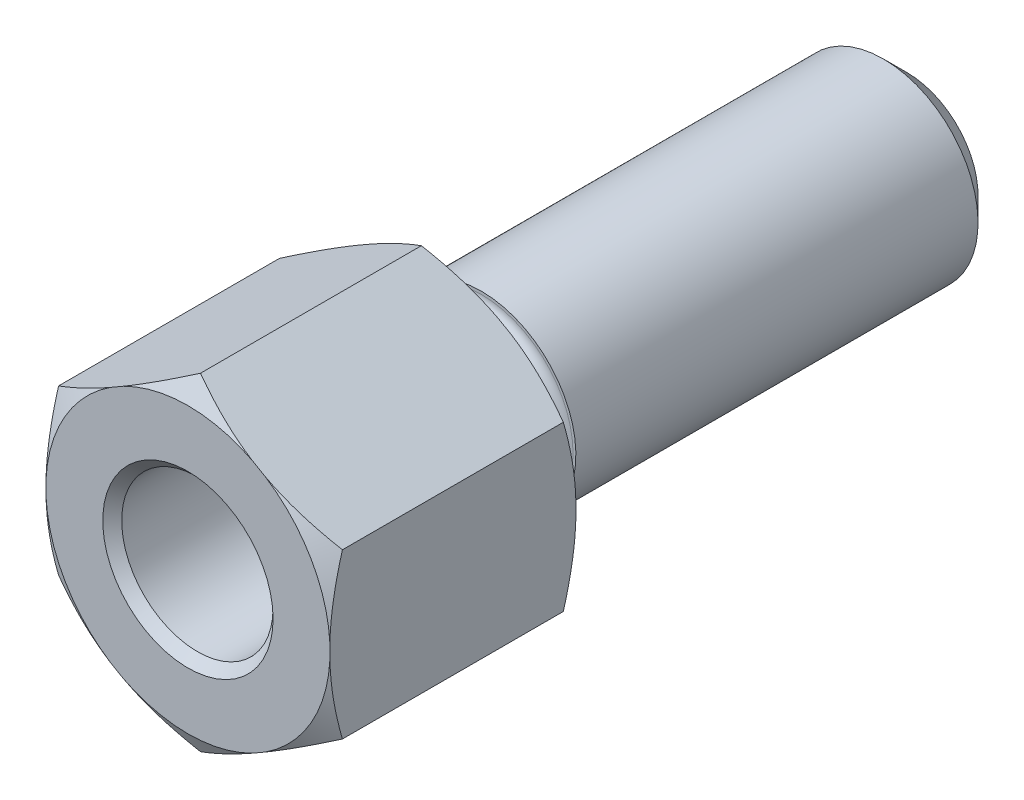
ISO-10303-21;
HEADER;
FILE_DESCRIPTION(('STEP AP214'),'2;1');
FILE_NAME('part.step','',(''),(''),'','','');
FILE_SCHEMA(('AUTOMOTIVE_DESIGN { 1 0 10303 214 1 1 1 1 }'));
ENDSEC;
DATA;
#1=APPLICATION_CONTEXT('core data for automotive mechanical design processes');
#2=APPLICATION_PROTOCOL_DEFINITION('international standard','automotive_design',2000,#1);
#3=PRODUCT_CONTEXT('',#1,'mechanical');
#4=PRODUCT('Part','Part','',(#3));
#5=PRODUCT_RELATED_PRODUCT_CATEGORY('part','',(#4));
#6=PRODUCT_DEFINITION_FORMATION('','',#4);
#7=PRODUCT_DEFINITION_CONTEXT('part definition',#1,'design');
#8=PRODUCT_DEFINITION('design','',#6,#7);
#9=PRODUCT_DEFINITION_SHAPE('','',#8);
#10=(LENGTH_UNIT() NAMED_UNIT(*) SI_UNIT(.MILLI.,.METRE.));
#11=(NAMED_UNIT(*) PLANE_ANGLE_UNIT() SI_UNIT($,.RADIAN.));
#12=(NAMED_UNIT(*) SI_UNIT($,.STERADIAN.) SOLID_ANGLE_UNIT());
#13=UNCERTAINTY_MEASURE_WITH_UNIT(LENGTH_MEASURE(1.E-05),#10,'distance_accuracy_value','');
#14=(GEOMETRIC_REPRESENTATION_CONTEXT(3) GLOBAL_UNCERTAINTY_ASSIGNED_CONTEXT((#13)) GLOBAL_UNIT_ASSIGNED_CONTEXT((#10,
#11,#12)) REPRESENTATION_CONTEXT('',''));
#15=CARTESIAN_POINT('',(0.,0.,0.));
#16=DIRECTION('',(0.,0.,1.));
#17=DIRECTION('',(1.,0.,0.));
#18=AXIS2_PLACEMENT_3D('',#15,#16,#17);
#19=CARTESIAN_POINT('',(0.,17.3205080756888,0.));
#20=DIRECTION('',(0.,0.,1.));
#21=DIRECTION('',(1.,0.,0.));
#22=AXIS2_PLACEMENT_3D('',#19,#20,#21);
#23=PLANE('',#22);
#24=CARTESIAN_POINT('',(0.,0.,0.));
#25=DIRECTION('',(0.,0.,1.));
#26=DIRECTION('',(1.,0.,0.));
#27=AXIS2_PLACEMENT_3D('',#24,#25,#26);
#28=CIRCLE('',#27,9.7);
#29=CARTESIAN_POINT('',(9.7,0.,0.));
#30=VERTEX_POINT('',#29);
#31=EDGE_CURVE('E9',#30,#30,#28,.T.);
#32=ORIENTED_EDGE('',*,*,#31,.T.);
#33=EDGE_LOOP('',(#32));
#34=FACE_BOUND('',#33,.T.);
#35=DIRECTION('',(0.,1.,0.));
#36=VECTOR('',#35,1.);
#37=CARTESIAN_POINT('',(15.,-8.66025403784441,0.));
#38=LINE('',#37,#36);
#39=CARTESIAN_POINT('',(15.,-0.784641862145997,0.));
#40=VERTEX_POINT('',#39);
#41=CARTESIAN_POINT('',(15.,0.784641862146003,0.));
#42=VERTEX_POINT('',#41);
#43=EDGE_CURVE('E172',#40,#42,#38,.T.);
#44=ORIENTED_EDGE('',*,*,#43,.F.);
#45=CARTESIAN_POINT('',(0.,0.,0.));
#46=DIRECTION('',(0.,0.,1.));
#47=DIRECTION('',(1.,0.,0.));
#48=AXIS2_PLACEMENT_3D('',#45,#46,#47);
#49=CIRCLE('',#48,15.0205080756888);
#50=CARTESIAN_POINT('',(8.17951978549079,-12.5980601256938,0.));
#51=VERTEX_POINT('',#50);
#52=EDGE_CURVE('E201',#40,#51,#49,.F.);
#53=ORIENTED_EDGE('',*,*,#52,.T.);
#54=DIRECTION('',(0.866025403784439,0.5,0.));
#55=VECTOR('',#54,1.);
#56=CARTESIAN_POINT('',(0.,-17.3205080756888,0.));
#57=LINE('',#56,#55);
#58=CARTESIAN_POINT('',(6.82048021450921,-13.3827019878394,0.));
#59=VERTEX_POINT('',#58);
#60=EDGE_CURVE('E164',#59,#51,#57,.T.);
#61=ORIENTED_EDGE('',*,*,#60,.F.);
#62=CARTESIAN_POINT('',(-6.82048021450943,-13.3827019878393,0.));
#63=VERTEX_POINT('',#62);
#64=EDGE_CURVE('E395',#59,#63,#49,.F.);
#65=ORIENTED_EDGE('',*,*,#64,.T.);
#66=DIRECTION('',(0.866025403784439,-0.5,0.));
#67=VECTOR('',#66,1.);
#68=CARTESIAN_POINT('',(-15.,-8.6602540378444,0.));
#69=LINE('',#68,#67);
#70=CARTESIAN_POINT('',(-8.17951978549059,-12.5980601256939,0.));
#71=VERTEX_POINT('',#70);
#72=EDGE_CURVE('E160',#71,#63,#69,.T.);
#73=ORIENTED_EDGE('',*,*,#72,.F.);
#74=CARTESIAN_POINT('',(-15.,-0.784641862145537,0.));
#75=VERTEX_POINT('',#74);
#76=EDGE_CURVE('E159',#71,#75,#49,.F.);
#77=ORIENTED_EDGE('',*,*,#76,.T.);
#78=DIRECTION('',(0.,-1.,0.));
#79=VECTOR('',#78,1.);
#80=CARTESIAN_POINT('',(-15.,8.66025403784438,0.));
#81=LINE('',#80,#79);
#82=CARTESIAN_POINT('',(-15.,0.78464186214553,0.));
#83=VERTEX_POINT('',#82);
#84=EDGE_CURVE('E152',#83,#75,#81,.T.);
#85=ORIENTED_EDGE('',*,*,#84,.F.);
#86=CARTESIAN_POINT('',(0.,0.,0.));
#87=DIRECTION('',(0.,0.,-1.));
#88=DIRECTION('',(-1.,0.,0.));
#89=AXIS2_PLACEMENT_3D('',#86,#87,#88);
#90=CIRCLE('',#89,15.0205080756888);
#91=CARTESIAN_POINT('',(-8.17951978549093,12.5980601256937,0.));
#92=VERTEX_POINT('',#91);
#93=EDGE_CURVE('E137',#83,#92,#90,.T.);
#94=ORIENTED_EDGE('',*,*,#93,.T.);
#95=DIRECTION('',(-0.866025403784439,-0.5,0.));
#96=VECTOR('',#95,1.);
#97=CARTESIAN_POINT('',(0.,17.3205080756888,0.));
#98=LINE('',#97,#96);
#99=CARTESIAN_POINT('',(-6.82048021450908,13.3827019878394,0.));
#100=VERTEX_POINT('',#99);
#101=EDGE_CURVE('E161',#100,#92,#98,.T.);
#102=ORIENTED_EDGE('',*,*,#101,.F.);
#103=CARTESIAN_POINT('',(6.82048021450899,13.3827019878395,0.));
#104=VERTEX_POINT('',#103);
#105=EDGE_CURVE('E200',#100,#104,#49,.F.);
#106=ORIENTED_EDGE('',*,*,#105,.T.);
#107=DIRECTION('',(-0.866025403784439,0.5,0.));
#108=VECTOR('',#107,1.);
#109=CARTESIAN_POINT('',(15.,8.66025403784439,0.));
#110=LINE('',#109,#108);
#111=CARTESIAN_POINT('',(8.17951978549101,12.5980601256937,0.));
#112=VERTEX_POINT('',#111);
#113=EDGE_CURVE('E166',#112,#104,#110,.T.);
#114=ORIENTED_EDGE('',*,*,#113,.F.);
#115=EDGE_CURVE('E197',#112,#42,#49,.F.);
#116=ORIENTED_EDGE('',*,*,#115,.T.);
#117=EDGE_LOOP('',(#44,#53,#61,#65,#73,#77,#85,#94,#102,#106,#114,#116));
#118=FACE_BOUND('',#117,.T.);
#119=ADVANCED_FACE('F14',(#34,#118),#23,.F.);
#120=CARTESIAN_POINT('',(15.,8.66025403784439,26.));
#121=DIRECTION('',(-0.5,-0.866025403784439,0.));
#122=DIRECTION('',(0.866025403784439,-0.5,0.));
#123=AXIS2_PLACEMENT_3D('',#120,#121,#122);
#124=PLANE('',#123);
#125=DIRECTION('',(0.,0.,-1.));
#126=VECTOR('',#125,1.);
#127=CARTESIAN_POINT('',(15.,8.66025403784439,26.));
#128=LINE('',#127,#126);
#129=CARTESIAN_POINT('',(15.,8.6602540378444,24.6720943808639));
#130=VERTEX_POINT('',#129);
#131=CARTESIAN_POINT('',(15.,8.6602540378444,1.32790561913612));
#132=VERTEX_POINT('',#131);
#133=EDGE_CURVE('E176',#130,#132,#128,.T.);
#134=ORIENTED_EDGE('',*,*,#133,.T.);
#135=CARTESIAN_POINT('',(25.4230019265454,2.64253106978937,6.08496039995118));
#136=CARTESIAN_POINT('',(25.1873411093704,2.77858990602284,5.9577540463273));
#137=CARTESIAN_POINT('',(24.9513948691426,2.91481353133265,5.83125318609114));
#138=CARTESIAN_POINT('',(24.47888154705,3.18761922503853,5.57980054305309));
#139=CARTESIAN_POINT('',(24.2423144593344,3.3242012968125,5.45484877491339));
#140=CARTESIAN_POINT('',(23.5315584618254,3.73455646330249,5.08249894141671));
#141=CARTESIAN_POINT('',(23.0563696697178,4.0089068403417,4.83763603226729));
#142=CARTESIAN_POINT('',(22.1013757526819,4.56027283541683,4.35527383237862));
#143=CARTESIAN_POINT('',(21.621560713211,4.83729417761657,4.1178006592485));
#144=CARTESIAN_POINT('',(20.6583383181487,5.39341088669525,3.65279499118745));
#145=CARTESIAN_POINT('',(20.174931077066,5.67250618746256,3.42526218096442));
#146=CARTESIAN_POINT('',(19.1915803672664,6.24024398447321,2.97667666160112));
#147=CARTESIAN_POINT('',(18.6915293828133,6.52894855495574,2.75593675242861));
#148=CARTESIAN_POINT('',(17.686385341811,7.10926873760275,2.33016390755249));
#149=CARTESIAN_POINT('',(17.1812920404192,7.40088449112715,2.1251317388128));
#150=CARTESIAN_POINT('',(16.1659444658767,7.98709568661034,1.73467374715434));
#151=CARTESIAN_POINT('',(15.6556956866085,8.28168795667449,1.54922905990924));
#152=CARTESIAN_POINT('',(14.6292075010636,8.8743311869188,1.20222311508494));
#153=CARTESIAN_POINT('',(14.1129688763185,9.1723816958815,1.04065877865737));
#154=CARTESIAN_POINT('',(12.8784941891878,9.88510598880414,0.691191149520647));
#155=CARTESIAN_POINT('',(12.1573831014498,10.3014396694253,0.516272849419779));
#156=CARTESIAN_POINT('',(11.0683367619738,10.9302008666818,0.305955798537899));
#157=CARTESIAN_POINT('',(10.7041089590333,11.1404878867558,0.244528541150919));
#158=CARTESIAN_POINT('',(9.97360702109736,11.5622433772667,0.140561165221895));
#159=CARTESIAN_POINT('',(9.60733290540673,11.7737118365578,0.0980208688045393));
#160=CARTESIAN_POINT('',(8.87770749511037,12.1949612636,0.0334304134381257));
#161=CARTESIAN_POINT('',(8.51437171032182,12.4047332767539,0.0111478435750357));
#162=CARTESIAN_POINT('',(7.78719022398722,12.8245717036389,-0.0131073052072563));
#163=CARTESIAN_POINT('',(7.42334452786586,13.0346381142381,-0.0150800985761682));
#164=CARTESIAN_POINT('',(6.69600266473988,13.4545691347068,0.00134685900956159));
#165=CARTESIAN_POINT('',(6.33250649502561,13.6644337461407,0.0197464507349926));
#166=CARTESIAN_POINT('',(5.60663502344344,14.0835158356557,0.076361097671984));
#167=CARTESIAN_POINT('',(5.24425990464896,14.2927332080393,0.114579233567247));
#168=CARTESIAN_POINT('',(4.38859435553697,14.7867519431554,0.227251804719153));
#169=CARTESIAN_POINT('',(3.89610296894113,15.0710919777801,0.309859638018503));
#170=CARTESIAN_POINT('',(2.91582392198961,15.6370563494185,0.506281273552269));
#171=CARTESIAN_POINT('',(2.42803695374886,15.9186802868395,0.620099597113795));
#172=CARTESIAN_POINT('',(1.45723028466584,16.4791757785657,0.874646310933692));
#173=CARTESIAN_POINT('',(0.974216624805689,16.7580438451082,1.01540510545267));
#174=CARTESIAN_POINT('',(0.0136075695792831,17.3126517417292,1.31939742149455));
#175=CARTESIAN_POINT('',(-0.463988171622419,17.5883917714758,1.48262949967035));
#176=CARTESIAN_POINT('',(-1.41975911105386,18.1402063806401,1.82974807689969));
#177=CARTESIAN_POINT('',(-1.89787297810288,18.4162455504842,2.01385816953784));
#178=CARTESIAN_POINT('',(-2.84903503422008,18.9653992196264,2.39756921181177));
#179=CARTESIAN_POINT('',(-3.32208634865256,19.2385155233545,2.59715989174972));
#180=CARTESIAN_POINT('',(-4.26384887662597,19.7822423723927,3.00907588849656));
#181=CARTESIAN_POINT('',(-4.73256121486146,20.0528535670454,3.2213977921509));
#182=CARTESIAN_POINT('',(-5.6663626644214,20.5919840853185,3.65658266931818));
#183=CARTESIAN_POINT('',(-6.13145128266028,20.8605031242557,3.87944704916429));
#184=CARTESIAN_POINT('',(-6.91838148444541,21.3148374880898,4.2652204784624));
#185=CARTESIAN_POINT('',(-7.24104644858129,21.5011281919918,4.4258994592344));
#186=CARTESIAN_POINT('',(-7.88495375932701,21.872888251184,4.75098003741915));
#187=CARTESIAN_POINT('',(-8.2061961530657,22.0583576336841,4.91538151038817));
#188=CARTESIAN_POINT('',(-8.84400318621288,22.4265956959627,5.24570416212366));
#189=CARTESIAN_POINT('',(-9.1605812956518,22.6093721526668,5.41159071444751));
#190=CARTESIAN_POINT('',(-9.79260977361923,22.9742739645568,5.74622188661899));
#191=CARTESIAN_POINT('',(-10.1080601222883,23.1563993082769,5.9149665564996));
#192=CARTESIAN_POINT('',(-10.4230019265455,23.3382310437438,6.08496039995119));
#193=B_SPLINE_CURVE_WITH_KNOTS('',3,(#135,#136,#137,#138,#139,#140,#141,#142,#143,#144,#145,
#146,#147,#148,#149,#150,#151,#152,#153,#154,#155,#156,#157,#158,#159,#160,#161,#162,#163,#164,
#165,#166,#167,#168,#169,#170,#171,#172,#173,#174,#175,#176,#177,#178,#179,#180,#181,#182,#183,
#184,#185,#186,#187,#188,#189,#190,#191,#192),.UNSPECIFIED.,.F.,.F.,(4,2,2,2,2,2,2,2,2,2,2,2,2,
2,2,2,2,2,2,2,2,2,2,2,2,2,2,2,4),(0.,0.901144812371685,1.80229814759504,3.60481465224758,
5.41310862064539,7.22134519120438,9.0756522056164,10.9300497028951,12.7826446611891,
14.635000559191,17.184758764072,18.4595159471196,19.7342611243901,20.9941898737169,
22.254105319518,23.5140109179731,24.7741124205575,26.4970163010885,28.2201699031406,
29.9452797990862,31.6702789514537,33.4159004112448,35.1603735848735,36.9043811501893,
38.6486220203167,39.8658579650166,41.0830532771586,42.2873352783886,43.4916383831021),.UNSPECIFIED.);
#194=EDGE_CURVE('E243',#132,#112,#193,.T.);
#195=ORIENTED_EDGE('',*,*,#194,.T.);
#196=ORIENTED_EDGE('',*,*,#113,.T.);
#197=CARTESIAN_POINT('',(0.,17.3205080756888,1.32790561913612));
#198=VERTEX_POINT('',#197);
#199=EDGE_CURVE('E377',#104,#198,#193,.T.);
#200=ORIENTED_EDGE('',*,*,#199,.T.);
#201=DIRECTION('',(0.,0.,-1.));
#202=VECTOR('',#201,1.);
#203=CARTESIAN_POINT('',(0.,17.3205080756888,26.));
#204=LINE('',#203,#202);
#205=CARTESIAN_POINT('',(0.,17.3205080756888,24.6720943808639));
#206=VERTEX_POINT('',#205);
#207=EDGE_CURVE('E190',#206,#198,#204,.T.);
#208=ORIENTED_EDGE('',*,*,#207,.F.);
#209=CARTESIAN_POINT('',(-10.4230019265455,23.3382310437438,19.9150396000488));
#210=CARTESIAN_POINT('',(-10.1873411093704,23.2021722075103,20.0422459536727));
#211=CARTESIAN_POINT('',(-9.95139486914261,23.0659485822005,20.1687468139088));
#212=CARTESIAN_POINT('',(-9.47888154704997,22.7931428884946,20.4201994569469));
#213=CARTESIAN_POINT('',(-9.24231445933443,22.6565608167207,20.5451512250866));
#214=CARTESIAN_POINT('',(-8.53155846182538,22.2462056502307,20.9175010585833));
#215=CARTESIAN_POINT('',(-8.05636966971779,21.9718552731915,21.1623639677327));
#216=CARTESIAN_POINT('',(-7.10137575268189,21.4204892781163,21.6447261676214));
#217=CARTESIAN_POINT('',(-6.62156071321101,21.1434679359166,21.8821993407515));
#218=CARTESIAN_POINT('',(-5.65833831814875,20.5873512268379,22.3472050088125));
#219=CARTESIAN_POINT('',(-5.17493107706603,20.3082559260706,22.5747378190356));
#220=CARTESIAN_POINT('',(-4.19158036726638,19.74051812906,23.0233233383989));
#221=CARTESIAN_POINT('',(-3.69152938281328,19.4518135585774,23.2440632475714));
#222=CARTESIAN_POINT('',(-2.68638534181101,18.8714933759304,23.6698360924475));
#223=CARTESIAN_POINT('',(-2.18129204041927,18.579877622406,23.8748682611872));
#224=CARTESIAN_POINT('',(-1.16594446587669,17.9936664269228,24.2653262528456));
#225=CARTESIAN_POINT('',(-0.655695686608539,17.6990741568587,24.4507709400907));
#226=CARTESIAN_POINT('',(0.370792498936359,17.1064309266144,24.797776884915));
#227=CARTESIAN_POINT('',(0.887031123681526,16.8083804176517,24.9593412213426));
#228=CARTESIAN_POINT('',(2.12150581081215,16.095656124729,25.3088088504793));
#229=CARTESIAN_POINT('',(2.84261689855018,15.6793224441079,25.4837271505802));
#230=CARTESIAN_POINT('',(3.9316632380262,15.0505612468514,25.6940442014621));
#231=CARTESIAN_POINT('',(4.29589104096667,14.8402742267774,25.7554714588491));
#232=CARTESIAN_POINT('',(5.02639297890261,14.4185187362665,25.8594388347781));
#233=CARTESIAN_POINT('',(5.39266709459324,14.2070502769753,25.9019791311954));
#234=CARTESIAN_POINT('',(6.12229250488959,13.7858008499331,25.9665695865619));
#235=CARTESIAN_POINT('',(6.48562828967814,13.5760288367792,25.9888521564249));
#236=CARTESIAN_POINT('',(7.21280977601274,13.1561904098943,26.0131073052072));
#237=CARTESIAN_POINT('',(7.5766554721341,12.9461239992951,26.0150800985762));
#238=CARTESIAN_POINT('',(8.30399733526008,12.5261929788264,25.9986531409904));
#239=CARTESIAN_POINT('',(8.66749350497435,12.3163283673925,25.980253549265));
#240=CARTESIAN_POINT('',(9.39336497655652,11.8972462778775,25.923638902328));
#241=CARTESIAN_POINT('',(9.75574009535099,11.6880289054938,25.8854207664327));
#242=CARTESIAN_POINT('',(10.611405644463,11.1940101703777,25.7727481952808));
#243=CARTESIAN_POINT('',(11.1038970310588,10.9096701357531,25.6901403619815));
#244=CARTESIAN_POINT('',(12.0841760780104,10.3437057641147,25.4937187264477));
#245=CARTESIAN_POINT('',(12.5719630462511,10.0620818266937,25.3799004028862));
#246=CARTESIAN_POINT('',(13.5427697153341,9.50158633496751,25.1253536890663));
#247=CARTESIAN_POINT('',(14.0257833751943,9.22271826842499,24.9845948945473));
#248=CARTESIAN_POINT('',(14.9863924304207,8.66811037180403,24.6806025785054));
#249=CARTESIAN_POINT('',(15.4639881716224,8.39237034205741,24.5173705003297));
#250=CARTESIAN_POINT('',(16.4197591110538,7.84055573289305,24.1702519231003));
#251=CARTESIAN_POINT('',(16.8978729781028,7.56451656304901,23.9861418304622));
#252=CARTESIAN_POINT('',(17.84903503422,7.01536289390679,23.6024307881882));
#253=CARTESIAN_POINT('',(18.3220863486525,6.74224659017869,23.4028401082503));
#254=CARTESIAN_POINT('',(19.2638488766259,6.19851974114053,22.9909241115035));
#255=CARTESIAN_POINT('',(19.7325612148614,5.92790854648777,22.7786022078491));
#256=CARTESIAN_POINT('',(20.6663626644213,5.38877802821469,22.3434173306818));
#257=CARTESIAN_POINT('',(21.1314512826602,5.12025898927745,22.1205529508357));
#258=CARTESIAN_POINT('',(21.9183814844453,4.66592462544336,21.7347795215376));
#259=CARTESIAN_POINT('',(22.2410464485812,4.47963392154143,21.5741005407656));
#260=CARTESIAN_POINT('',(22.884953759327,4.10787386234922,21.2490199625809));
#261=CARTESIAN_POINT('',(23.2061961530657,3.92240447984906,21.0846184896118));
#262=CARTESIAN_POINT('',(23.8440031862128,3.55416641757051,20.7542958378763));
#263=CARTESIAN_POINT('',(24.1605812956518,3.3713899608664,20.5884092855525));
#264=CARTESIAN_POINT('',(24.7926097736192,3.00648814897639,20.253778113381));
#265=CARTESIAN_POINT('',(25.1080601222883,2.82436280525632,20.0850334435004));
#266=CARTESIAN_POINT('',(25.4230019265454,2.64253106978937,19.9150396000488));
#267=B_SPLINE_CURVE_WITH_KNOTS('',3,(#209,#210,#211,#212,#213,#214,#215,#216,#217,#218,#219,
#220,#221,#222,#223,#224,#225,#226,#227,#228,#229,#230,#231,#232,#233,#234,#235,#236,#237,#238,
#239,#240,#241,#242,#243,#244,#245,#246,#247,#248,#249,#250,#251,#252,#253,#254,#255,#256,#257,
#258,#259,#260,#261,#262,#263,#264,#265,#266),.UNSPECIFIED.,.F.,.F.,(4,2,2,2,2,2,2,2,2,2,2,2,2,
2,2,2,2,2,2,2,2,2,2,2,2,2,2,2,4),(0.,0.901144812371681,1.80229814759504,3.60481465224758,
5.41310862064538,7.22134519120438,9.07565220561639,10.9300497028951,12.7826446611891,
14.635000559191,17.184758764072,18.4595159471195,19.7342611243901,20.9941898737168,
22.254105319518,23.5140109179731,24.7741124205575,26.4970163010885,28.2201699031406,
29.9452797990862,31.6702789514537,33.4159004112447,35.1603735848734,36.9043811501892,
38.6486220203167,39.8658579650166,41.0830532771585,42.2873352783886,43.491638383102),.UNSPECIFIED.);
#268=CARTESIAN_POINT('',(6.82048021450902,13.3827019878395,26.));
#269=VERTEX_POINT('',#268);
#270=EDGE_CURVE('E343',#206,#269,#267,.T.);
#271=ORIENTED_EDGE('',*,*,#270,.T.);
#272=DIRECTION('',(-0.866025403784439,0.5,0.));
#273=VECTOR('',#272,1.);
#274=CARTESIAN_POINT('',(15.,8.66025403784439,26.));
#275=LINE('',#274,#273);
#276=CARTESIAN_POINT('',(8.17951978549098,12.5980601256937,26.));
#277=VERTEX_POINT('',#276);
#278=EDGE_CURVE('E175',#277,#269,#275,.T.);
#279=ORIENTED_EDGE('',*,*,#278,.F.);
#280=EDGE_CURVE('E349',#277,#130,#267,.T.);
#281=ORIENTED_EDGE('',*,*,#280,.T.);
#282=EDGE_LOOP('',(#134,#195,#196,#200,#208,#271,#279,#281));
#283=FACE_BOUND('',#282,.T.);
#284=ADVANCED_FACE('F401',(#283),#124,.F.);
#285=CARTESIAN_POINT('',(0.,17.3205080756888,26.));
#286=DIRECTION('',(0.5,-0.866025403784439,0.));
#287=DIRECTION('',(0.866025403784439,0.5,0.));
#288=AXIS2_PLACEMENT_3D('',#285,#286,#287);
#289=PLANE('',#288);
#290=ORIENTED_EDGE('',*,*,#207,.T.);
#291=CARTESIAN_POINT('',(10.4230019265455,23.3382310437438,6.0849603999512));
#292=CARTESIAN_POINT('',(10.1873411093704,23.2021722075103,5.95775404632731));
#293=CARTESIAN_POINT('',(9.95139486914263,23.0659485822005,5.83125318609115));
#294=CARTESIAN_POINT('',(9.47888154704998,22.7931428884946,5.57980054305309));
#295=CARTESIAN_POINT('',(9.24231445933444,22.6565608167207,5.45484877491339));
#296=CARTESIAN_POINT('',(8.53155846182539,22.2462056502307,5.08249894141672));
#297=CARTESIAN_POINT('',(8.0563696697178,21.9718552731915,4.8376360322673));
#298=CARTESIAN_POINT('',(7.1013757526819,21.4204892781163,4.35527383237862));
#299=CARTESIAN_POINT('',(6.62156071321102,21.1434679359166,4.1178006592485));
#300=CARTESIAN_POINT('',(5.65833831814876,20.5873512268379,3.65279499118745));
#301=CARTESIAN_POINT('',(5.17493107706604,20.3082559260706,3.42526218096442));
#302=CARTESIAN_POINT('',(4.19158036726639,19.74051812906,2.97667666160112));
#303=CARTESIAN_POINT('',(3.69152938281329,19.4518135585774,2.75593675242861));
#304=CARTESIAN_POINT('',(2.68638534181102,18.8714933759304,2.33016390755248));
#305=CARTESIAN_POINT('',(2.18129204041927,18.579877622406,2.1251317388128));
#306=CARTESIAN_POINT('',(1.1659444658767,17.9936664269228,1.73467374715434));
#307=CARTESIAN_POINT('',(0.655695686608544,17.6990741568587,1.54922905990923));
#308=CARTESIAN_POINT('',(-0.370792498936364,17.1064309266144,1.20222311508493));
#309=CARTESIAN_POINT('',(-0.88703112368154,16.8083804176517,1.04065877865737));
#310=CARTESIAN_POINT('',(-2.12150581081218,16.095656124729,0.691191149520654));
#311=CARTESIAN_POINT('',(-2.84261689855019,15.6793224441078,0.516272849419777));
#312=CARTESIAN_POINT('',(-3.93166323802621,15.0505612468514,0.305955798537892));
#313=CARTESIAN_POINT('',(-4.29589104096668,14.8402742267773,0.244528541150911));
#314=CARTESIAN_POINT('',(-5.02639297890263,14.4185187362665,0.140561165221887));
#315=CARTESIAN_POINT('',(-5.39266709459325,14.2070502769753,0.098020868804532));
#316=CARTESIAN_POINT('',(-6.12229250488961,13.7858008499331,0.033430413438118));
#317=CARTESIAN_POINT('',(-6.48562828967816,13.5760288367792,0.0111478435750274));
#318=CARTESIAN_POINT('',(-7.21280977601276,13.1561904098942,-0.0131073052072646));
#319=CARTESIAN_POINT('',(-7.57665547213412,12.9461239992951,-0.0150800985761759));
#320=CARTESIAN_POINT('',(-8.3039973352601,12.5261929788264,0.00134685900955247));
#321=CARTESIAN_POINT('',(-8.66749350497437,12.3163283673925,0.0197464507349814));
#322=CARTESIAN_POINT('',(-9.39336497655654,11.8972462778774,0.0763610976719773));
#323=CARTESIAN_POINT('',(-9.75574009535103,11.6880289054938,0.114579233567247));
#324=CARTESIAN_POINT('',(-10.611405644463,11.1940101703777,0.227251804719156));
#325=CARTESIAN_POINT('',(-11.1038970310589,10.909670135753,0.309859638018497));
#326=CARTESIAN_POINT('',(-12.0841760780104,10.3437057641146,0.506281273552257));
#327=CARTESIAN_POINT('',(-12.5719630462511,10.0620818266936,0.620099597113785));
#328=CARTESIAN_POINT('',(-13.5427697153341,9.50158633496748,0.874646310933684));
#329=CARTESIAN_POINT('',(-14.0257833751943,9.22271826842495,1.01540510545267));
#330=CARTESIAN_POINT('',(-14.9863924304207,8.668110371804,1.31939742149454));
#331=CARTESIAN_POINT('',(-15.4639881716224,8.39237034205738,1.48262949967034));
#332=CARTESIAN_POINT('',(-16.4197591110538,7.84055573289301,1.82974807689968));
#333=CARTESIAN_POINT('',(-16.8978729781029,7.56451656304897,2.01385816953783));
#334=CARTESIAN_POINT('',(-17.8490350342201,7.01536289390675,2.39756921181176));
#335=CARTESIAN_POINT('',(-18.3220863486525,6.74224659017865,2.59715989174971));
#336=CARTESIAN_POINT('',(-19.263848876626,6.19851974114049,3.00907588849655));
#337=CARTESIAN_POINT('',(-19.7325612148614,5.92790854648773,3.22139779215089));
#338=CARTESIAN_POINT('',(-20.6663626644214,5.38877802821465,3.65658266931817));
#339=CARTESIAN_POINT('',(-21.1314512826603,5.12025898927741,3.87944704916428));
#340=CARTESIAN_POINT('',(-21.9183814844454,4.66592462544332,4.26522047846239));
#341=CARTESIAN_POINT('',(-22.2410464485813,4.47963392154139,4.42589945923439));
#342=CARTESIAN_POINT('',(-22.884953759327,4.10787386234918,4.75098003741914));
#343=CARTESIAN_POINT('',(-23.2061961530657,3.92240447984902,4.91538151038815));
#344=CARTESIAN_POINT('',(-23.8440031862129,3.55416641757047,5.24570416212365));
#345=CARTESIAN_POINT('',(-24.1605812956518,3.37138996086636,5.41159071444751));
#346=CARTESIAN_POINT('',(-24.7926097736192,3.00648814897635,5.74622188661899));
#347=CARTESIAN_POINT('',(-25.1080601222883,2.82436280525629,5.9149665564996));
#348=CARTESIAN_POINT('',(-25.4230019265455,2.64253106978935,6.08496039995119));
#349=B_SPLINE_CURVE_WITH_KNOTS('',3,(#291,#292,#293,#294,#295,#296,#297,#298,#299,#300,#301,
#302,#303,#304,#305,#306,#307,#308,#309,#310,#311,#312,#313,#314,#315,#316,#317,#318,#319,#320,
#321,#322,#323,#324,#325,#326,#327,#328,#329,#330,#331,#332,#333,#334,#335,#336,#337,#338,#339,
#340,#341,#342,#343,#344,#345,#346,#347,#348),.UNSPECIFIED.,.F.,.F.,(4,2,2,2,2,2,2,2,2,2,2,2,2,
2,2,2,2,2,2,2,2,2,2,2,2,2,2,2,4),(0.,0.901144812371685,1.80229814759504,3.60481465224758,
5.41310862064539,7.22134519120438,9.0756522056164,10.9300497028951,12.7826446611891,
14.635000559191,17.184758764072,18.4595159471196,19.7342611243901,20.9941898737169,
22.254105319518,23.5140109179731,24.7741124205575,26.4970163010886,28.2201699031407,
29.9452797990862,31.6702789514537,33.4159004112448,35.1603735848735,36.9043811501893,
38.6486220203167,39.8658579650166,41.0830532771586,42.2873352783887,43.4916383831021),.UNSPECIFIED.);
#350=EDGE_CURVE('E380',#198,#100,#349,.T.);
#351=ORIENTED_EDGE('',*,*,#350,.T.);
#352=ORIENTED_EDGE('',*,*,#101,.T.);
#353=CARTESIAN_POINT('',(-15.,8.66025403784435,1.32790561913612));
#354=VERTEX_POINT('',#353);
#355=EDGE_CURVE('E30',#92,#354,#349,.T.);
#356=ORIENTED_EDGE('',*,*,#355,.T.);
#357=DIRECTION('',(0.,0.,-1.));
#358=VECTOR('',#357,1.);
#359=CARTESIAN_POINT('',(-15.,8.66025403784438,26.));
#360=LINE('',#359,#358);
#361=CARTESIAN_POINT('',(-15.,8.66025403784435,24.6720943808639));
#362=VERTEX_POINT('',#361);
#363=EDGE_CURVE('E155',#362,#354,#360,.T.);
#364=ORIENTED_EDGE('',*,*,#363,.F.);
#365=CARTESIAN_POINT('',(-25.4230019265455,2.64253106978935,19.9150396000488));
#366=CARTESIAN_POINT('',(-25.1873411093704,2.77858990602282,20.0422459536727));
#367=CARTESIAN_POINT('',(-24.9513948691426,2.91481353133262,20.1687468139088));
#368=CARTESIAN_POINT('',(-24.47888154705,3.18761922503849,20.4201994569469));
#369=CARTESIAN_POINT('',(-24.2423144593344,3.32420129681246,20.5451512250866));
#370=CARTESIAN_POINT('',(-23.5315584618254,3.73455646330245,20.9175010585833));
#371=CARTESIAN_POINT('',(-23.0563696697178,4.00890684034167,21.1623639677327));
#372=CARTESIAN_POINT('',(-22.1013757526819,4.5602728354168,21.6447261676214));
#373=CARTESIAN_POINT('',(-21.621560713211,4.83729417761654,21.8821993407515));
#374=CARTESIAN_POINT('',(-20.6583383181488,5.39341088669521,22.3472050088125));
#375=CARTESIAN_POINT('',(-20.174931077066,5.67250618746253,22.5747378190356));
#376=CARTESIAN_POINT('',(-19.1915803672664,6.24024398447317,23.0233233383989));
#377=CARTESIAN_POINT('',(-18.6915293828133,6.52894855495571,23.2440632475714));
#378=CARTESIAN_POINT('',(-17.686385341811,7.10926873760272,23.6698360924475));
#379=CARTESIAN_POINT('',(-17.1812920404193,7.40088449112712,23.8748682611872));
#380=CARTESIAN_POINT('',(-16.1659444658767,7.98709568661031,24.2653262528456));
#381=CARTESIAN_POINT('',(-15.6556956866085,8.28168795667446,24.4507709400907));
#382=CARTESIAN_POINT('',(-14.6292075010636,8.87433118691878,24.797776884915));
#383=CARTESIAN_POINT('',(-14.1129688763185,9.17238169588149,24.9593412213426));
#384=CARTESIAN_POINT('',(-12.8784941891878,9.88510598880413,25.3088088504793));
#385=CARTESIAN_POINT('',(-12.1573831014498,10.3014396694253,25.4837271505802));
#386=CARTESIAN_POINT('',(-11.0683367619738,10.9302008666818,25.6940442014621));
#387=CARTESIAN_POINT('',(-10.7041089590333,11.1404878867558,25.7554714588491));
#388=CARTESIAN_POINT('',(-9.97360702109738,11.5622433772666,25.8594388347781));
#389=CARTESIAN_POINT('',(-9.60733290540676,11.7737118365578,25.9019791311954));
#390=CARTESIAN_POINT('',(-8.8777074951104,12.1949612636,25.9665695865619));
#391=CARTESIAN_POINT('',(-8.51437171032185,12.4047332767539,25.988852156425));
#392=CARTESIAN_POINT('',(-7.78719022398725,12.8245717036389,26.0131073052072));
#393=CARTESIAN_POINT('',(-7.42334452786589,13.0346381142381,26.0150800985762));
#394=CARTESIAN_POINT('',(-6.69600266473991,13.4545691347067,25.9986531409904));
#395=CARTESIAN_POINT('',(-6.33250649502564,13.6644337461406,25.980253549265));
#396=CARTESIAN_POINT('',(-5.60663502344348,14.0835158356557,25.923638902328));
#397=CARTESIAN_POINT('',(-5.244259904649,14.2927332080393,25.8854207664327));
#398=CARTESIAN_POINT('',(-4.38859435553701,14.7867519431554,25.7727481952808));
#399=CARTESIAN_POINT('',(-3.89610296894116,15.0710919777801,25.6901403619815));
#400=CARTESIAN_POINT('',(-2.91582392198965,15.6370563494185,25.4937187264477));
#401=CARTESIAN_POINT('',(-2.4280369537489,15.9186802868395,25.3799004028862));
#402=CARTESIAN_POINT('',(-1.45723028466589,16.4791757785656,25.1253536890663));
#403=CARTESIAN_POINT('',(-0.974216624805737,16.7580438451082,24.9845948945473));
#404=CARTESIAN_POINT('',(-0.0136075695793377,17.3126517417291,24.6806025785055));
#405=CARTESIAN_POINT('',(0.463988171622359,17.5883917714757,24.5173705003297));
#406=CARTESIAN_POINT('',(1.41975911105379,18.1402063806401,24.1702519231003));
#407=CARTESIAN_POINT('',(1.89787297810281,18.4162455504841,23.9861418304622));
#408=CARTESIAN_POINT('',(2.84903503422,18.9653992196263,23.6024307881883));
#409=CARTESIAN_POINT('',(3.32208634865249,19.2385155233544,23.4028401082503));
#410=CARTESIAN_POINT('',(4.26384887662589,19.7822423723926,22.9909241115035));
#411=CARTESIAN_POINT('',(4.73256121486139,20.0528535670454,22.7786022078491));
#412=CARTESIAN_POINT('',(5.66636266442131,20.5919840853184,22.3434173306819));
#413=CARTESIAN_POINT('',(6.13145128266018,20.8605031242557,22.1205529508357));
#414=CARTESIAN_POINT('',(6.91838148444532,21.3148374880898,21.7347795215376));
#415=CARTESIAN_POINT('',(7.24104644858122,21.5011281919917,21.5741005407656));
#416=CARTESIAN_POINT('',(7.88495375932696,21.8728882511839,21.2490199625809));
#417=CARTESIAN_POINT('',(8.20619615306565,22.0583576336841,21.0846184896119));
#418=CARTESIAN_POINT('',(8.84400318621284,22.4265956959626,20.7542958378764));
#419=CARTESIAN_POINT('',(9.16058129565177,22.6093721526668,20.5884092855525));
#420=CARTESIAN_POINT('',(9.79260977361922,22.9742739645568,20.253778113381));
#421=CARTESIAN_POINT('',(10.1080601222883,23.1563993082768,20.0850334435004));
#422=CARTESIAN_POINT('',(10.4230019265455,23.3382310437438,19.9150396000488));
#423=B_SPLINE_CURVE_WITH_KNOTS('',3,(#365,#366,#367,#368,#369,#370,#371,#372,#373,#374,#375,
#376,#377,#378,#379,#380,#381,#382,#383,#384,#385,#386,#387,#388,#389,#390,#391,#392,#393,#394,
#395,#396,#397,#398,#399,#400,#401,#402,#403,#404,#405,#406,#407,#408,#409,#410,#411,#412,#413,
#414,#415,#416,#417,#418,#419,#420,#421,#422),.UNSPECIFIED.,.F.,.F.,(4,2,2,2,2,2,2,2,2,2,2,2,2,
2,2,2,2,2,2,2,2,2,2,2,2,2,2,2,4),(0.,0.901144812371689,1.80229814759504,3.60481465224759,
5.4131086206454,7.22134519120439,9.07565220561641,10.9300497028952,12.7826446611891,
14.635000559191,17.184758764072,18.4595159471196,19.7342611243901,20.9941898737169,
22.254105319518,23.5140109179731,24.7741124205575,26.4970163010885,28.2201699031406,
29.9452797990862,31.6702789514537,33.4159004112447,35.1603735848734,36.9043811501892,
38.6486220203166,39.8658579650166,41.0830532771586,42.2873352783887,43.4916383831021),.UNSPECIFIED.);
#424=CARTESIAN_POINT('',(-8.1795197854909,12.5980601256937,26.));
#425=VERTEX_POINT('',#424);
#426=EDGE_CURVE('E319',#362,#425,#423,.T.);
#427=ORIENTED_EDGE('',*,*,#426,.T.);
#428=DIRECTION('',(-0.866025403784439,-0.5,0.));
#429=VECTOR('',#428,1.);
#430=CARTESIAN_POINT('',(0.,17.3205080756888,26.));
#431=LINE('',#430,#429);
#432=CARTESIAN_POINT('',(-6.82048021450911,13.3827019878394,26.));
#433=VERTEX_POINT('',#432);
#434=EDGE_CURVE('E329',#433,#425,#431,.T.);
#435=ORIENTED_EDGE('',*,*,#434,.F.);
#436=EDGE_CURVE('E326',#433,#206,#423,.T.);
#437=ORIENTED_EDGE('',*,*,#436,.T.);
#438=EDGE_LOOP('',(#290,#351,#352,#356,#364,#427,#435,#437));
#439=FACE_BOUND('',#438,.T.);
#440=ADVANCED_FACE('F298',(#439),#289,.F.);
#441=CARTESIAN_POINT('',(-15.,8.66025403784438,26.));
#442=DIRECTION('',(1.,0.,0.));
#443=DIRECTION('',(0.,1.,0.));
#444=AXIS2_PLACEMENT_3D('',#441,#442,#443);
#445=PLANE('',#444);
#446=ORIENTED_EDGE('',*,*,#363,.T.);
#447=CARTESIAN_POINT('',(-15.,19.0832559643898,5.34183509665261));
#448=CARTESIAN_POINT('',(-15.,18.8122869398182,5.21884162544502));
#449=CARTESIAN_POINT('',(-15.,18.5409436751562,5.09667329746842));
#450=CARTESIAN_POINT('',(-15.,17.9974421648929,4.85415360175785));
#451=CARTESIAN_POINT('',(-15.,17.7252839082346,4.73380225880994));
#452=CARTESIAN_POINT('',(-15.,16.9074065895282,4.37568870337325));
#453=CARTESIAN_POINT('',(-15.,16.3603757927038,4.14090831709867));
#454=CARTESIAN_POINT('',(-15.,15.2599850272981,3.68000584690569));
#455=CARTESIAN_POINT('',(-15.,14.7066081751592,3.45392396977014));
#456=CARTESIAN_POINT('',(-15.,13.5951789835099,3.01358716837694));
#457=CARTESIAN_POINT('',(-15.,13.0371268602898,2.79933170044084));
#458=CARTESIAN_POINT('',(-15.,11.9181507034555,2.38620712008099));
#459=CARTESIAN_POINT('',(-15.,11.357250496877,2.18727378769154));
#460=CARTESIAN_POINT('',(-15.,10.2294562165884,1.80696840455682));
#461=CARTESIAN_POINT('',(-15.,9.66256184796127,1.62559722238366));
#462=CARTESIAN_POINT('',(-15.,8.52304587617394,1.28456604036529));
#463=CARTESIAN_POINT('',(-15.,7.95043280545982,1.12487774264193));
#464=CARTESIAN_POINT('',(-15.,6.79857956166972,0.831480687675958));
#465=CARTESIAN_POINT('',(-15.,6.21934032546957,0.697768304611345));
#466=CARTESIAN_POINT('',(-15.,5.21947075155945,0.494696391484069));
#467=CARTESIAN_POINT('',(-15.,4.80036332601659,0.417835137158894));
#468=CARTESIAN_POINT('',(-15.,3.9592820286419,0.281732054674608));
#469=CARTESIAN_POINT('',(-15.,3.53730824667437,0.222489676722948));
#470=CARTESIAN_POINT('',(-15.,2.69119949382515,0.12318973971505));
#471=CARTESIAN_POINT('',(-15.,2.26706509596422,0.0831273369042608));
#472=CARTESIAN_POINT('',(-15.,1.4173529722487,0.0233279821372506));
#473=CARTESIAN_POINT('',(-15.,0.991775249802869,0.00359098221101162));
#474=CARTESIAN_POINT('',(-15.,0.140380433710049,-0.0149421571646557));
#475=CARTESIAN_POINT('',(-15.,-0.285436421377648,-0.0137491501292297));
#476=CARTESIAN_POINT('',(-15.,-1.13649131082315,0.00951308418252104));
#477=CARTESIAN_POINT('',(-15.,-1.56172934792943,0.0315822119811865));
#478=CARTESIAN_POINT('',(-15.,-2.41070587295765,0.095922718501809));
#479=CARTESIAN_POINT('',(-15.,-2.83444420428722,0.138196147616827));
#480=CARTESIAN_POINT('',(-15.,-3.67958328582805,0.241728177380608));
#481=CARTESIAN_POINT('',(-15.,-4.10098393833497,0.302987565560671));
#482=CARTESIAN_POINT('',(-15.,-5.15132842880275,0.477988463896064));
#483=CARTESIAN_POINT('',(-15.,-5.77846191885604,0.602646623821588));
#484=CARTESIAN_POINT('',(-15.,-7.02520247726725,0.885174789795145));
#485=CARTESIAN_POINT('',(-15.,-7.64480783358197,1.04305220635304));
#486=CARTESIAN_POINT('',(-15.,-8.87772381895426,1.38642881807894));
#487=CARTESIAN_POINT('',(-15.,-9.49101743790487,1.57198850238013));
#488=CARTESIAN_POINT('',(-15.,-10.7103687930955,1.96520204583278));
#489=CARTESIAN_POINT('',(-15.,-11.3164270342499,2.17285435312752));
#490=CARTESIAN_POINT('',(-15.,-12.529060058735,2.60841149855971));
#491=CARTESIAN_POINT('',(-15.,-13.1355605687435,2.83652185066));
#492=CARTESIAN_POINT('',(-15.,-14.3428850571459,3.30733580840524));
#493=CARTESIAN_POINT('',(-15.,-14.9437086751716,3.55004033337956));
#494=CARTESIAN_POINT('',(-15.,-16.1367276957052,4.04565541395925));
#495=CARTESIAN_POINT('',(-15.,-16.7289535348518,4.29849293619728));
#496=CARTESIAN_POINT('',(-15.,-17.6141171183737,4.68480051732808));
#497=CARTESIAN_POINT('',(-15.,-17.9086085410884,4.81472947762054));
#498=CARTESIAN_POINT('',(-15.,-18.4966311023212,5.07672919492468));
#499=CARTESIAN_POINT('',(-15.,-18.790162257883,5.20879991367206));
#500=CARTESIAN_POINT('',(-15.,-19.0832559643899,5.34183509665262));
#501=B_SPLINE_CURVE_WITH_KNOTS('',3,(#447,#448,#449,#450,#451,#452,#453,#454,#455,#456,#457,
#458,#459,#460,#461,#462,#463,#464,#465,#466,#467,#468,#469,#470,#471,#472,#473,#474,#475,#476,
#477,#478,#479,#480,#481,#482,#483,#484,#485,#486,#487,#488,#489,#490,#491,#492,#493,#494,#495,
#496,#497,#498,#499,#500),.UNSPECIFIED.,.F.,.F.,(4,2,2,2,2,2,2,2,2,2,2,2,2,2,2,2,2,2,2,2,2,2,2,
2,2,2,4),(0.,0.892726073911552,1.7854643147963,3.57124012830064,5.36446583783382,
7.15760904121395,8.9427736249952,10.7280264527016,12.5109265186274,14.2935775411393,
15.5715431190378,16.8494688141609,18.1270716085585,19.4046713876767,20.6816086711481,
21.9585398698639,23.2356006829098,24.5127144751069,26.4297663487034,28.3472463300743,
30.2689793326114,32.1905774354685,34.1342828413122,36.0781108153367,38.0098243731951,
38.9754575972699,39.941073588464),.UNSPECIFIED.);
#502=EDGE_CURVE('E140',#354,#83,#501,.T.);
#503=ORIENTED_EDGE('',*,*,#502,.T.);
#504=ORIENTED_EDGE('',*,*,#84,.T.);
#505=CARTESIAN_POINT('',(-15.,-8.66025403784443,1.32790561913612));
#506=VERTEX_POINT('',#505);
#507=EDGE_CURVE('E38',#75,#506,#501,.T.);
#508=ORIENTED_EDGE('',*,*,#507,.T.);
#509=DIRECTION('',(0.,0.,-1.));
#510=VECTOR('',#509,1.);
#511=CARTESIAN_POINT('',(-15.,-8.6602540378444,26.));
#512=LINE('',#511,#510);
#513=CARTESIAN_POINT('',(-15.,-8.66025403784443,24.6720943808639));
#514=VERTEX_POINT('',#513);
#515=EDGE_CURVE('E186',#514,#506,#512,.T.);
#516=ORIENTED_EDGE('',*,*,#515,.F.);
#517=CARTESIAN_POINT('',(-15.,-19.0832559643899,20.6581649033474));
#518=CARTESIAN_POINT('',(-15.,-18.8122869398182,20.7811583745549));
#519=CARTESIAN_POINT('',(-15.,-18.5409436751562,20.9033267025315));
#520=CARTESIAN_POINT('',(-15.,-17.9974421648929,21.1458463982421));
#521=CARTESIAN_POINT('',(-15.,-17.7252839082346,21.26619774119));
#522=CARTESIAN_POINT('',(-15.,-16.9074065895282,21.6243112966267));
#523=CARTESIAN_POINT('',(-15.,-16.3603757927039,21.8590916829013));
#524=CARTESIAN_POINT('',(-15.,-15.2599850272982,22.3199941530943));
#525=CARTESIAN_POINT('',(-15.,-14.7066081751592,22.5460760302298));
#526=CARTESIAN_POINT('',(-15.,-13.59517898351,22.986412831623));
#527=CARTESIAN_POINT('',(-15.,-13.0371268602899,23.2006682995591));
#528=CARTESIAN_POINT('',(-15.,-11.9181507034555,23.613792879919));
#529=CARTESIAN_POINT('',(-15.,-11.357250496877,23.8127262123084));
#530=CARTESIAN_POINT('',(-15.,-10.2294562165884,24.1930315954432));
#531=CARTESIAN_POINT('',(-15.,-9.6625618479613,24.3744027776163));
#532=CARTESIAN_POINT('',(-15.,-8.52304587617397,24.7154339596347));
#533=CARTESIAN_POINT('',(-15.,-7.95043280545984,24.875122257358));
#534=CARTESIAN_POINT('',(-15.,-6.79857956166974,25.168519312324));
#535=CARTESIAN_POINT('',(-15.,-6.2193403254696,25.3022316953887));
#536=CARTESIAN_POINT('',(-15.,-5.21947075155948,25.5053036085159));
#537=CARTESIAN_POINT('',(-15.,-4.80036332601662,25.5821648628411));
#538=CARTESIAN_POINT('',(-15.,-3.95928202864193,25.7182679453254));
#539=CARTESIAN_POINT('',(-15.,-3.5373082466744,25.777510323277));
#540=CARTESIAN_POINT('',(-15.,-2.69119949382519,25.8768102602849));
#541=CARTESIAN_POINT('',(-15.,-2.26706509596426,25.9168726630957));
#542=CARTESIAN_POINT('',(-15.,-1.41735297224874,25.9766720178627));
#543=CARTESIAN_POINT('',(-15.,-0.991775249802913,25.996409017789));
#544=CARTESIAN_POINT('',(-15.,-0.140380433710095,26.0149421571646));
#545=CARTESIAN_POINT('',(-15.,0.2854364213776,26.0137491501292));
#546=CARTESIAN_POINT('',(-15.,1.13649131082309,25.9904869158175));
#547=CARTESIAN_POINT('',(-15.,1.56172934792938,25.9684177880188));
#548=CARTESIAN_POINT('',(-15.,2.41070587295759,25.9040772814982));
#549=CARTESIAN_POINT('',(-15.,2.83444420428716,25.8618038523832));
#550=CARTESIAN_POINT('',(-15.,3.67958328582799,25.7582718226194));
#551=CARTESIAN_POINT('',(-15.,4.10098393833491,25.6970124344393));
#552=CARTESIAN_POINT('',(-15.,5.15132842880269,25.522011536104));
#553=CARTESIAN_POINT('',(-15.,5.77846191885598,25.3973533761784));
#554=CARTESIAN_POINT('',(-15.,7.02520247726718,25.1148252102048));
#555=CARTESIAN_POINT('',(-15.,7.6448078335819,24.956947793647));
#556=CARTESIAN_POINT('',(-15.,8.8777238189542,24.6135711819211));
#557=CARTESIAN_POINT('',(-15.,9.4910174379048,24.4280114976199));
#558=CARTESIAN_POINT('',(-15.,10.7103687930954,24.0347979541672));
#559=CARTESIAN_POINT('',(-15.,11.3164270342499,23.8271456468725));
#560=CARTESIAN_POINT('',(-15.,12.529060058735,23.3915885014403));
#561=CARTESIAN_POINT('',(-15.,13.1355605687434,23.16347814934));
#562=CARTESIAN_POINT('',(-15.,14.3428850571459,22.6926641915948));
#563=CARTESIAN_POINT('',(-15.,14.9437086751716,22.4499596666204));
#564=CARTESIAN_POINT('',(-15.,16.1367276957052,21.9543445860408));
#565=CARTESIAN_POINT('',(-15.,16.7289535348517,21.7015070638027));
#566=CARTESIAN_POINT('',(-15.,17.6141171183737,21.3151994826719));
#567=CARTESIAN_POINT('',(-15.,17.9086085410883,21.1852705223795));
#568=CARTESIAN_POINT('',(-15.,18.4966311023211,20.9232708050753));
#569=CARTESIAN_POINT('',(-15.,18.790162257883,20.7912000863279));
#570=CARTESIAN_POINT('',(-15.,19.0832559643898,20.6581649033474));
#571=B_SPLINE_CURVE_WITH_KNOTS('',3,(#517,#518,#519,#520,#521,#522,#523,#524,#525,#526,#527,
#528,#529,#530,#531,#532,#533,#534,#535,#536,#537,#538,#539,#540,#541,#542,#543,#544,#545,#546,
#547,#548,#549,#550,#551,#552,#553,#554,#555,#556,#557,#558,#559,#560,#561,#562,#563,#564,#565,
#566,#567,#568,#569,#570),.UNSPECIFIED.,.F.,.F.,(4,2,2,2,2,2,2,2,2,2,2,2,2,2,2,2,2,2,2,2,2,2,2,
2,2,2,4),(0.,0.892726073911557,1.7854643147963,3.57124012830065,5.36446583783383,
7.15760904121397,8.94277362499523,10.7280264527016,12.5109265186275,14.2935775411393,
15.5715431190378,16.8494688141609,18.1270716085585,19.4046713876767,20.6816086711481,
21.9585398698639,23.2356006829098,24.5127144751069,26.4297663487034,28.3472463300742,
30.2689793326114,32.1905774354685,34.1342828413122,36.0781108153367,38.0098243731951,
38.9754575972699,39.941073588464),.UNSPECIFIED.);
#572=CARTESIAN_POINT('',(-15.,-0.784641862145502,26.));
#573=VERTEX_POINT('',#572);
#574=EDGE_CURVE('E303',#514,#573,#571,.T.);
#575=ORIENTED_EDGE('',*,*,#574,.T.);
#576=DIRECTION('',(0.,-1.,0.));
#577=VECTOR('',#576,1.);
#578=CARTESIAN_POINT('',(-15.,8.66025403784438,26.));
#579=LINE('',#578,#577);
#580=CARTESIAN_POINT('',(-15.,0.784641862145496,26.));
#581=VERTEX_POINT('',#580);
#582=EDGE_CURVE('E332',#581,#573,#579,.T.);
#583=ORIENTED_EDGE('',*,*,#582,.F.);
#584=EDGE_CURVE('E311',#581,#362,#571,.T.);
#585=ORIENTED_EDGE('',*,*,#584,.T.);
#586=EDGE_LOOP('',(#446,#503,#504,#508,#516,#575,#583,#585));
#587=FACE_BOUND('',#586,.T.);
#588=ADVANCED_FACE('F151',(#587),#445,.F.);
#589=CARTESIAN_POINT('',(-15.,-8.6602540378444,26.));
#590=DIRECTION('',(0.5,0.866025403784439,0.));
#591=DIRECTION('',(-0.866025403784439,0.5,0.));
#592=AXIS2_PLACEMENT_3D('',#589,#590,#591);
#593=PLANE('',#592);
#594=ORIENTED_EDGE('',*,*,#515,.T.);
#595=CARTESIAN_POINT('',(-25.4230019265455,-2.64253106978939,6.0849603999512));
#596=CARTESIAN_POINT('',(-25.1873411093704,-2.77858990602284,5.95775404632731));
#597=CARTESIAN_POINT('',(-24.9513948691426,-2.91481353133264,5.83125318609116));
#598=CARTESIAN_POINT('',(-24.47888154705,-3.18761922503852,5.57980054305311));
#599=CARTESIAN_POINT('',(-24.2423144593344,-3.32420129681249,5.4548487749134));
#600=CARTESIAN_POINT('',(-23.5315584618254,-3.73455646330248,5.08249894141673));
#601=CARTESIAN_POINT('',(-23.0563696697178,-4.00890684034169,4.83763603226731));
#602=CARTESIAN_POINT('',(-22.1013757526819,-4.56027283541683,4.35527383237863));
#603=CARTESIAN_POINT('',(-21.621560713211,-4.83729417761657,4.11780065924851));
#604=CARTESIAN_POINT('',(-20.6583383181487,-5.39341088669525,3.65279499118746));
#605=CARTESIAN_POINT('',(-20.174931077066,-5.67250618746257,3.42526218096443));
#606=CARTESIAN_POINT('',(-19.1915803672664,-6.24024398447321,2.97667666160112));
#607=CARTESIAN_POINT('',(-18.6915293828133,-6.52894855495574,2.75593675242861));
#608=CARTESIAN_POINT('',(-17.686385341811,-7.10926873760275,2.33016390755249));
#609=CARTESIAN_POINT('',(-17.1812920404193,-7.40088449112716,2.12513173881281));
#610=CARTESIAN_POINT('',(-16.1659444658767,-7.98709568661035,1.73467374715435));
#611=CARTESIAN_POINT('',(-15.6556956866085,-8.2816879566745,1.54922905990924));
#612=CARTESIAN_POINT('',(-14.6292075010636,-8.87433118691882,1.20222311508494));
#613=CARTESIAN_POINT('',(-14.1129688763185,-9.17238169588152,1.04065877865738));
#614=CARTESIAN_POINT('',(-12.8784941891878,-9.88510598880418,0.691191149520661));
#615=CARTESIAN_POINT('',(-12.1573831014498,-10.3014396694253,0.516272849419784));
#616=CARTESIAN_POINT('',(-11.0683367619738,-10.9302008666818,0.3059557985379));
#617=CARTESIAN_POINT('',(-10.7041089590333,-11.1404878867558,0.24452854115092));
#618=CARTESIAN_POINT('',(-9.97360702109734,-11.5622433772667,0.140561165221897));
#619=CARTESIAN_POINT('',(-9.60733290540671,-11.7737118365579,0.0980208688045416));
#620=CARTESIAN_POINT('',(-8.87770749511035,-12.1949612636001,0.0334304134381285));
#621=CARTESIAN_POINT('',(-8.5143717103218,-12.404733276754,0.0111478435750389));
#622=CARTESIAN_POINT('',(-7.7871902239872,-12.824571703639,-0.0131073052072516));
#623=CARTESIAN_POINT('',(-7.42334452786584,-13.0346381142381,-0.0150800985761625));
#624=CARTESIAN_POINT('',(-6.69600266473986,-13.4545691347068,0.00134685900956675));
#625=CARTESIAN_POINT('',(-6.33250649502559,-13.6644337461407,0.0197464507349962));
#626=CARTESIAN_POINT('',(-5.60663502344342,-14.0835158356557,0.0763610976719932));
#627=CARTESIAN_POINT('',(-5.24425990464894,-14.2927332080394,0.114579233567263));
#628=CARTESIAN_POINT('',(-4.38859435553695,-14.7867519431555,0.227251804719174));
#629=CARTESIAN_POINT('',(-3.8961029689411,-15.0710919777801,0.309859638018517));
#630=CARTESIAN_POINT('',(-2.91582392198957,-15.6370563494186,0.50628127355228));
#631=CARTESIAN_POINT('',(-2.42803695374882,-15.9186802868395,0.62009959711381));
#632=CARTESIAN_POINT('',(-1.45723028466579,-16.4791757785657,0.874646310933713));
#633=CARTESIAN_POINT('',(-0.974216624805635,-16.7580438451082,1.01540510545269));
#634=CARTESIAN_POINT('',(-0.0136075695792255,-17.3126517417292,1.31939742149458));
#635=CARTESIAN_POINT('',(0.463988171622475,-17.5883917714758,1.48262949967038));
#636=CARTESIAN_POINT('',(1.41975911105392,-18.1402063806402,1.82974807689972));
#637=CARTESIAN_POINT('',(1.89787297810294,-18.4162455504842,2.01385816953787));
#638=CARTESIAN_POINT('',(2.84903503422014,-18.9653992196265,2.3975692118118));
#639=CARTESIAN_POINT('',(3.32208634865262,-19.2385155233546,2.59715989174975));
#640=CARTESIAN_POINT('',(4.26384887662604,-19.7822423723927,3.00907588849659));
#641=CARTESIAN_POINT('',(4.73256121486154,-20.0528535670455,3.22139779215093));
#642=CARTESIAN_POINT('',(5.66636266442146,-20.5919840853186,3.65658266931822));
#643=CARTESIAN_POINT('',(6.13145128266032,-20.8605031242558,3.87944704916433));
#644=CARTESIAN_POINT('',(6.91838148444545,-21.3148374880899,4.26522047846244));
#645=CARTESIAN_POINT('',(7.24104644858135,-21.5011281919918,4.42589945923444));
#646=CARTESIAN_POINT('',(7.88495375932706,-21.872888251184,4.75098003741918));
#647=CARTESIAN_POINT('',(8.20619615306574,-22.0583576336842,4.91538151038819));
#648=CARTESIAN_POINT('',(8.84400318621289,-22.4265956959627,5.24570416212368));
#649=CARTESIAN_POINT('',(9.16058129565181,-22.6093721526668,5.41159071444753));
#650=CARTESIAN_POINT('',(9.79260977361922,-22.9742739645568,5.74622188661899));
#651=CARTESIAN_POINT('',(10.1080601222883,-23.1563993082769,5.9149665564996));
#652=CARTESIAN_POINT('',(10.4230019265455,-23.3382310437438,6.08496039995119));
#653=B_SPLINE_CURVE_WITH_KNOTS('',3,(#595,#596,#597,#598,#599,#600,#601,#602,#603,#604,#605,
#606,#607,#608,#609,#610,#611,#612,#613,#614,#615,#616,#617,#618,#619,#620,#621,#622,#623,#624,
#625,#626,#627,#628,#629,#630,#631,#632,#633,#634,#635,#636,#637,#638,#639,#640,#641,#642,#643,
#644,#645,#646,#647,#648,#649,#650,#651,#652),.UNSPECIFIED.,.F.,.F.,(4,2,2,2,2,2,2,2,2,2,2,2,2,
2,2,2,2,2,2,2,2,2,2,2,2,2,2,2,4),(0.,0.901144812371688,1.80229814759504,3.60481465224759,
5.41310862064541,7.22134519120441,9.07565220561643,10.9300497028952,12.7826446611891,
14.6350005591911,17.184758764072,18.4595159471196,19.7342611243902,20.9941898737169,
22.2541053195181,23.5140109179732,24.7741124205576,26.4970163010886,28.2201699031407,
29.9452797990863,31.6702789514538,33.4159004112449,35.1603735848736,36.9043811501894,
38.6486220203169,39.8658579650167,41.0830532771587,42.2873352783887,43.4916383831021),.UNSPECIFIED.);
#654=EDGE_CURVE('E288',#506,#71,#653,.T.);
#655=ORIENTED_EDGE('',*,*,#654,.T.);
#656=ORIENTED_EDGE('',*,*,#72,.T.);
#657=CARTESIAN_POINT('',(0.,-17.3205080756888,1.32790561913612));
#658=VERTEX_POINT('',#657);
#659=EDGE_CURVE('E277',#63,#658,#653,.T.);
#660=ORIENTED_EDGE('',*,*,#659,.T.);
#661=DIRECTION('',(0.,0.,-1.));
#662=VECTOR('',#661,1.);
#663=CARTESIAN_POINT('',(0.,-17.3205080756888,26.));
#664=LINE('',#663,#662);
#665=CARTESIAN_POINT('',(0.,-17.3205080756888,24.6720943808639));
#666=VERTEX_POINT('',#665);
#667=EDGE_CURVE('E183',#666,#658,#664,.T.);
#668=ORIENTED_EDGE('',*,*,#667,.F.);
#669=CARTESIAN_POINT('',(10.4230019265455,-23.3382310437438,19.9150396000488));
#670=CARTESIAN_POINT('',(10.1873411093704,-23.2021722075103,20.0422459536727));
#671=CARTESIAN_POINT('',(9.95139486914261,-23.0659485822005,20.1687468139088));
#672=CARTESIAN_POINT('',(9.47888154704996,-22.7931428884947,20.4201994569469));
#673=CARTESIAN_POINT('',(9.24231445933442,-22.6565608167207,20.5451512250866));
#674=CARTESIAN_POINT('',(8.53155846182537,-22.2462056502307,20.9175010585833));
#675=CARTESIAN_POINT('',(8.05636966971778,-21.9718552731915,21.1623639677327));
#676=CARTESIAN_POINT('',(7.10137575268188,-21.4204892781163,21.6447261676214));
#677=CARTESIAN_POINT('',(6.62156071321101,-21.1434679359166,21.8821993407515));
#678=CARTESIAN_POINT('',(5.65833831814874,-20.5873512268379,22.3472050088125));
#679=CARTESIAN_POINT('',(5.17493107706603,-20.3082559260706,22.5747378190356));
#680=CARTESIAN_POINT('',(4.19158036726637,-19.74051812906,23.0233233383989));
#681=CARTESIAN_POINT('',(3.69152938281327,-19.4518135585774,23.2440632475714));
#682=CARTESIAN_POINT('',(2.686385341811,-18.8714933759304,23.6698360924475));
#683=CARTESIAN_POINT('',(2.18129204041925,-18.579877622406,23.8748682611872));
#684=CARTESIAN_POINT('',(1.16594446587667,-17.9936664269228,24.2653262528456));
#685=CARTESIAN_POINT('',(0.655695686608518,-17.6990741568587,24.4507709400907));
#686=CARTESIAN_POINT('',(-0.370792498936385,-17.1064309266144,24.797776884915));
#687=CARTESIAN_POINT('',(-0.887031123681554,-16.8083804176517,24.9593412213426));
#688=CARTESIAN_POINT('',(-2.12150581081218,-16.095656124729,25.3088088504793));
#689=CARTESIAN_POINT('',(-2.84261689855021,-15.6793224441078,25.4837271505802));
#690=CARTESIAN_POINT('',(-3.93166323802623,-15.0505612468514,25.6940442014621));
#691=CARTESIAN_POINT('',(-4.2958910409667,-14.8402742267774,25.7554714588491));
#692=CARTESIAN_POINT('',(-5.02639297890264,-14.4185187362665,25.8594388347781));
#693=CARTESIAN_POINT('',(-5.39266709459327,-14.2070502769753,25.9019791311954));
#694=CARTESIAN_POINT('',(-6.12229250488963,-13.7858008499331,25.9665695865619));
#695=CARTESIAN_POINT('',(-6.48562828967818,-13.5760288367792,25.9888521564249));
#696=CARTESIAN_POINT('',(-7.21280977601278,-13.1561904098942,26.0131073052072));
#697=CARTESIAN_POINT('',(-7.57665547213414,-12.9461239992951,26.0150800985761));
#698=CARTESIAN_POINT('',(-8.30399733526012,-12.5261929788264,25.9986531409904));
#699=CARTESIAN_POINT('',(-8.66749350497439,-12.3163283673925,25.980253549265));
#700=CARTESIAN_POINT('',(-9.39336497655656,-11.8972462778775,25.923638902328));
#701=CARTESIAN_POINT('',(-9.75574009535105,-11.6880289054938,25.8854207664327));
#702=CARTESIAN_POINT('',(-10.611405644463,-11.1940101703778,25.7727481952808));
#703=CARTESIAN_POINT('',(-11.1038970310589,-10.9096701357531,25.6901403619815));
#704=CARTESIAN_POINT('',(-12.0841760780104,-10.3437057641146,25.4937187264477));
#705=CARTESIAN_POINT('',(-12.5719630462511,-10.0620818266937,25.3799004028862));
#706=CARTESIAN_POINT('',(-13.5427697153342,-9.5015863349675,25.1253536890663));
#707=CARTESIAN_POINT('',(-14.0257833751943,-9.22271826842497,24.9845948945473));
#708=CARTESIAN_POINT('',(-14.9863924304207,-8.66811037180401,24.6806025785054));
#709=CARTESIAN_POINT('',(-15.4639881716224,-8.39237034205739,24.5173705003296));
#710=CARTESIAN_POINT('',(-16.4197591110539,-7.84055573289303,24.1702519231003));
#711=CARTESIAN_POINT('',(-16.8978729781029,-7.56451656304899,23.9861418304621));
#712=CARTESIAN_POINT('',(-17.8490350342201,-7.01536289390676,23.6024307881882));
#713=CARTESIAN_POINT('',(-18.3220863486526,-6.74224659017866,23.4028401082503));
#714=CARTESIAN_POINT('',(-19.263848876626,-6.19851974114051,22.9909241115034));
#715=CARTESIAN_POINT('',(-19.7325612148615,-5.92790854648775,22.7786022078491));
#716=CARTESIAN_POINT('',(-20.6663626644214,-5.38877802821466,22.3434173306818));
#717=CARTESIAN_POINT('',(-21.1314512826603,-5.12025898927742,22.1205529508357));
#718=CARTESIAN_POINT('',(-21.9183814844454,-4.66592462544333,21.7347795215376));
#719=CARTESIAN_POINT('',(-22.2410464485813,-4.47963392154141,21.5741005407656));
#720=CARTESIAN_POINT('',(-22.884953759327,-4.1078738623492,21.2490199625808));
#721=CARTESIAN_POINT('',(-23.2061961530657,-3.92240447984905,21.0846184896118));
#722=CARTESIAN_POINT('',(-23.8440031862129,-3.55416641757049,20.7542958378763));
#723=CARTESIAN_POINT('',(-24.1605812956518,-3.37138996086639,20.5884092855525));
#724=CARTESIAN_POINT('',(-24.7926097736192,-3.00648814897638,20.253778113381));
#725=CARTESIAN_POINT('',(-25.1080601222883,-2.82436280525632,20.0850334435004));
#726=CARTESIAN_POINT('',(-25.4230019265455,-2.64253106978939,19.9150396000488));
#727=B_SPLINE_CURVE_WITH_KNOTS('',3,(#669,#670,#671,#672,#673,#674,#675,#676,#677,#678,#679,
#680,#681,#682,#683,#684,#685,#686,#687,#688,#689,#690,#691,#692,#693,#694,#695,#696,#697,#698,
#699,#700,#701,#702,#703,#704,#705,#706,#707,#708,#709,#710,#711,#712,#713,#714,#715,#716,#717,
#718,#719,#720,#721,#722,#723,#724,#725,#726),.UNSPECIFIED.,.F.,.F.,(4,2,2,2,2,2,2,2,2,2,2,2,2,
2,2,2,2,2,2,2,2,2,2,2,2,2,2,2,4),(0.,0.901144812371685,1.80229814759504,3.60481465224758,
5.41310862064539,7.22134519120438,9.0756522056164,10.9300497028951,12.7826446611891,
14.635000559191,17.184758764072,18.4595159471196,19.7342611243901,20.9941898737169,
22.254105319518,23.5140109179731,24.7741124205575,26.4970163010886,28.2201699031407,
29.9452797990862,31.6702789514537,33.4159004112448,35.1603735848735,36.9043811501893,
38.6486220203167,39.8658579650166,41.0830532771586,42.2873352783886,43.4916383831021),.UNSPECIFIED.);
#728=CARTESIAN_POINT('',(-6.82048021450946,-13.3827019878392,26.));
#729=VERTEX_POINT('',#728);
#730=EDGE_CURVE('E313',#666,#729,#727,.T.);
#731=ORIENTED_EDGE('',*,*,#730,.T.);
#732=DIRECTION('',(0.866025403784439,-0.5,0.));
#733=VECTOR('',#732,1.);
#734=CARTESIAN_POINT('',(-15.,-8.6602540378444,26.));
#735=LINE('',#734,#733);
#736=CARTESIAN_POINT('',(-8.17951978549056,-12.5980601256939,26.));
#737=VERTEX_POINT('',#736);
#738=EDGE_CURVE('E335',#737,#729,#735,.T.);
#739=ORIENTED_EDGE('',*,*,#738,.F.);
#740=EDGE_CURVE('E312',#737,#514,#727,.T.);
#741=ORIENTED_EDGE('',*,*,#740,.T.);
#742=EDGE_LOOP('',(#594,#655,#656,#660,#668,#731,#739,#741));
#743=FACE_BOUND('',#742,.T.);
#744=ADVANCED_FACE('F297',(#743),#593,.F.);
#745=CARTESIAN_POINT('',(0.,-17.3205080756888,26.));
#746=DIRECTION('',(-0.5,0.866025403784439,0.));
#747=DIRECTION('',(-0.866025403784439,-0.5,0.));
#748=AXIS2_PLACEMENT_3D('',#745,#746,#747);
#749=PLANE('',#748);
#750=ORIENTED_EDGE('',*,*,#667,.T.);
#751=CARTESIAN_POINT('',(-10.4230019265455,-23.3382310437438,6.0849603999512));
#752=CARTESIAN_POINT('',(-10.1873411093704,-23.2021722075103,5.95775404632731));
#753=CARTESIAN_POINT('',(-9.95139486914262,-23.0659485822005,5.83125318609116));
#754=CARTESIAN_POINT('',(-9.47888154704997,-22.7931428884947,5.57980054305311));
#755=CARTESIAN_POINT('',(-9.24231445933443,-22.6565608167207,5.45484877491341));
#756=CARTESIAN_POINT('',(-8.53155846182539,-22.2462056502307,5.08249894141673));
#757=CARTESIAN_POINT('',(-8.0563696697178,-21.9718552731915,4.83763603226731));
#758=CARTESIAN_POINT('',(-7.10137575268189,-21.4204892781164,4.35527383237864));
#759=CARTESIAN_POINT('',(-6.62156071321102,-21.1434679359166,4.11780065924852));
#760=CARTESIAN_POINT('',(-5.65833831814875,-20.5873512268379,3.65279499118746));
#761=CARTESIAN_POINT('',(-5.17493107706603,-20.3082559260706,3.42526218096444));
#762=CARTESIAN_POINT('',(-4.19158036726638,-19.74051812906,2.97667666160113));
#763=CARTESIAN_POINT('',(-3.69152938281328,-19.4518135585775,2.75593675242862));
#764=CARTESIAN_POINT('',(-2.686385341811,-18.8714933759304,2.3301639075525));
#765=CARTESIAN_POINT('',(-2.18129204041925,-18.579877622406,2.12513173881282));
#766=CARTESIAN_POINT('',(-1.16594446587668,-17.9936664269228,1.73467374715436));
#767=CARTESIAN_POINT('',(-0.655695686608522,-17.6990741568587,1.54922905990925));
#768=CARTESIAN_POINT('',(0.370792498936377,-17.1064309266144,1.20222311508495));
#769=CARTESIAN_POINT('',(0.887031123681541,-16.8083804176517,1.04065877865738));
#770=CARTESIAN_POINT('',(2.12150581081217,-16.095656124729,0.691191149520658));
#771=CARTESIAN_POINT('',(2.84261689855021,-15.6793224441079,0.516272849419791));
#772=CARTESIAN_POINT('',(3.93166323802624,-15.0505612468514,0.30595579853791));
#773=CARTESIAN_POINT('',(4.29589104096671,-14.8402742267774,0.244528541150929));
#774=CARTESIAN_POINT('',(5.02639297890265,-14.4185187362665,0.140561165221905));
#775=CARTESIAN_POINT('',(5.39266709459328,-14.2070502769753,0.0980208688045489));
#776=CARTESIAN_POINT('',(6.12229250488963,-13.7858008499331,0.0334304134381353));
#777=CARTESIAN_POINT('',(6.48562828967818,-13.5760288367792,0.0111478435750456));
#778=CARTESIAN_POINT('',(7.21280977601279,-13.1561904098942,-0.0131073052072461));
#779=CARTESIAN_POINT('',(7.57665547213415,-12.9461239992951,-0.015080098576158));
#780=CARTESIAN_POINT('',(8.30399733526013,-12.5261929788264,0.00134685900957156));
#781=CARTESIAN_POINT('',(8.6674935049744,-12.3163283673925,0.0197464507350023));
#782=CARTESIAN_POINT('',(9.39336497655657,-11.8972462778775,0.0763610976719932));
#783=CARTESIAN_POINT('',(9.75574009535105,-11.6880289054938,0.114579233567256));
#784=CARTESIAN_POINT('',(10.611405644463,-11.1940101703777,0.227251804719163));
#785=CARTESIAN_POINT('',(11.1038970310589,-10.9096701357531,0.309859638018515));
#786=CARTESIAN_POINT('',(12.0841760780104,-10.3437057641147,0.506281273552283));
#787=CARTESIAN_POINT('',(12.5719630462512,-10.0620818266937,0.620099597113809));
#788=CARTESIAN_POINT('',(13.5427697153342,-9.50158633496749,0.874646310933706));
#789=CARTESIAN_POINT('',(14.0257833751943,-9.22271826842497,1.01540510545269));
#790=CARTESIAN_POINT('',(14.9863924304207,-8.66811037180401,1.31939742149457));
#791=CARTESIAN_POINT('',(15.4639881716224,-8.39237034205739,1.48262949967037));
#792=CARTESIAN_POINT('',(16.4197591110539,-7.84055573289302,1.82974807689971));
#793=CARTESIAN_POINT('',(16.8978729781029,-7.56451656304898,2.01385816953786));
#794=CARTESIAN_POINT('',(17.8490350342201,-7.01536289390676,2.39756921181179));
#795=CARTESIAN_POINT('',(18.3220863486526,-6.74224659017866,2.59715989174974));
#796=CARTESIAN_POINT('',(19.263848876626,-6.1985197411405,3.00907588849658));
#797=CARTESIAN_POINT('',(19.7325612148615,-5.92790854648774,3.22139779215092));
#798=CARTESIAN_POINT('',(20.6663626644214,-5.38877802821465,3.6565826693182));
#799=CARTESIAN_POINT('',(21.1314512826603,-5.1202589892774,3.8794470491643));
#800=CARTESIAN_POINT('',(21.9183814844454,-4.66592462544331,4.26522047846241));
#801=CARTESIAN_POINT('',(22.2410464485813,-4.4796339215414,4.42589945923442));
#802=CARTESIAN_POINT('',(22.884953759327,-4.1078738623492,4.75098003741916));
#803=CARTESIAN_POINT('',(23.2061961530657,-3.92240447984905,4.91538151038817));
#804=CARTESIAN_POINT('',(23.8440031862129,-3.5541664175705,5.24570416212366));
#805=CARTESIAN_POINT('',(24.1605812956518,-3.3713899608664,5.41159071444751));
#806=CARTESIAN_POINT('',(24.7926097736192,-3.0064881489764,5.74622188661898));
#807=CARTESIAN_POINT('',(25.1080601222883,-2.82436280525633,5.91496655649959));
#808=CARTESIAN_POINT('',(25.4230019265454,-2.64253106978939,6.08496039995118));
#809=B_SPLINE_CURVE_WITH_KNOTS('',3,(#751,#752,#753,#754,#755,#756,#757,#758,#759,#760,#761,
#762,#763,#764,#765,#766,#767,#768,#769,#770,#771,#772,#773,#774,#775,#776,#777,#778,#779,#780,
#781,#782,#783,#784,#785,#786,#787,#788,#789,#790,#791,#792,#793,#794,#795,#796,#797,#798,#799,
#800,#801,#802,#803,#804,#805,#806,#807,#808),.UNSPECIFIED.,.F.,.F.,(4,2,2,2,2,2,2,2,2,2,2,2,2,
2,2,2,2,2,2,2,2,2,2,2,2,2,2,2,4),(0.,0.901144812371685,1.80229814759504,3.60481465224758,
5.41310862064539,7.22134519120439,9.07565220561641,10.9300497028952,12.7826446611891,
14.635000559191,17.184758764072,18.4595159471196,19.7342611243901,20.9941898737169,
22.2541053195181,23.5140109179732,24.7741124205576,26.4970163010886,28.2201699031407,
29.9452797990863,31.6702789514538,33.4159004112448,35.1603735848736,36.9043811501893,
38.6486220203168,39.8658579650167,41.0830532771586,42.2873352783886,43.491638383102),.UNSPECIFIED.);
#810=EDGE_CURVE('E384',#658,#59,#809,.T.);
#811=ORIENTED_EDGE('',*,*,#810,.T.);
#812=ORIENTED_EDGE('',*,*,#60,.T.);
#813=CARTESIAN_POINT('',(15.,-8.6602540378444,1.32790561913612));
#814=VERTEX_POINT('',#813);
#815=EDGE_CURVE('E271',#51,#814,#809,.T.);
#816=ORIENTED_EDGE('',*,*,#815,.T.);
#817=DIRECTION('',(0.,0.,-1.));
#818=VECTOR('',#817,1.);
#819=CARTESIAN_POINT('',(15.,-8.66025403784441,26.));
#820=LINE('',#819,#818);
#821=CARTESIAN_POINT('',(15.,-8.6602540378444,24.6720943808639));
#822=VERTEX_POINT('',#821);
#823=EDGE_CURVE('E179',#822,#814,#820,.T.);
#824=ORIENTED_EDGE('',*,*,#823,.F.);
#825=CARTESIAN_POINT('',(25.4230019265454,-2.6425310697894,19.9150396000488));
#826=CARTESIAN_POINT('',(25.1873411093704,-2.77858990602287,20.0422459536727));
#827=CARTESIAN_POINT('',(24.9513948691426,-2.91481353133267,20.1687468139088));
#828=CARTESIAN_POINT('',(24.47888154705,-3.18761922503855,20.4201994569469));
#829=CARTESIAN_POINT('',(24.2423144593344,-3.32420129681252,20.5451512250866));
#830=CARTESIAN_POINT('',(23.5315584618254,-3.7345564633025,20.9175010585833));
#831=CARTESIAN_POINT('',(23.0563696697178,-4.00890684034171,21.1623639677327));
#832=CARTESIAN_POINT('',(22.1013757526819,-4.56027283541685,21.6447261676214));
#833=CARTESIAN_POINT('',(21.621560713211,-4.83729417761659,21.8821993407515));
#834=CARTESIAN_POINT('',(20.6583383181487,-5.39341088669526,22.3472050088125));
#835=CARTESIAN_POINT('',(20.174931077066,-5.67250618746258,22.5747378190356));
#836=CARTESIAN_POINT('',(19.1915803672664,-6.24024398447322,23.0233233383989));
#837=CARTESIAN_POINT('',(18.6915293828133,-6.52894855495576,23.2440632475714));
#838=CARTESIAN_POINT('',(17.686385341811,-7.10926873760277,23.6698360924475));
#839=CARTESIAN_POINT('',(17.1812920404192,-7.40088449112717,23.8748682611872));
#840=CARTESIAN_POINT('',(16.1659444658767,-7.98709568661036,24.2653262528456));
#841=CARTESIAN_POINT('',(15.6556956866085,-8.28168795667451,24.4507709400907));
#842=CARTESIAN_POINT('',(14.6292075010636,-8.87433118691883,24.797776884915));
#843=CARTESIAN_POINT('',(14.1129688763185,-9.17238169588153,24.9593412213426));
#844=CARTESIAN_POINT('',(12.8784941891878,-9.88510598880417,25.3088088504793));
#845=CARTESIAN_POINT('',(12.1573831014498,-10.3014396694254,25.4837271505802));
#846=CARTESIAN_POINT('',(11.0683367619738,-10.9302008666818,25.6940442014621));
#847=CARTESIAN_POINT('',(10.7041089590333,-11.1404878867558,25.7554714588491));
#848=CARTESIAN_POINT('',(9.97360702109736,-11.5622433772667,25.8594388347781));
#849=CARTESIAN_POINT('',(9.60733290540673,-11.7737118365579,25.9019791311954));
#850=CARTESIAN_POINT('',(8.87770749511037,-12.1949612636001,25.9665695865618));
#851=CARTESIAN_POINT('',(8.51437171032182,-12.404733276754,25.9888521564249));
#852=CARTESIAN_POINT('',(7.78719022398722,-12.824571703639,26.0131073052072));
#853=CARTESIAN_POINT('',(7.42334452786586,-13.0346381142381,26.0150800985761));
#854=CARTESIAN_POINT('',(6.69600266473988,-13.4545691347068,25.9986531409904));
#855=CARTESIAN_POINT('',(6.33250649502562,-13.6644337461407,25.980253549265));
#856=CARTESIAN_POINT('',(5.60663502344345,-14.0835158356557,25.923638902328));
#857=CARTESIAN_POINT('',(5.24425990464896,-14.2927332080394,25.8854207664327));
#858=CARTESIAN_POINT('',(4.38859435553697,-14.7867519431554,25.7727481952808));
#859=CARTESIAN_POINT('',(3.89610296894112,-15.0710919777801,25.6901403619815));
#860=CARTESIAN_POINT('',(2.91582392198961,-15.6370563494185,25.4937187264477));
#861=CARTESIAN_POINT('',(2.42803695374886,-15.9186802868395,25.3799004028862));
#862=CARTESIAN_POINT('',(1.45723028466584,-16.4791757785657,25.1253536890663));
#863=CARTESIAN_POINT('',(0.974216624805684,-16.7580438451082,24.9845948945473));
#864=CARTESIAN_POINT('',(0.0136075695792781,-17.3126517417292,24.6806025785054));
#865=CARTESIAN_POINT('',(-0.463988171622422,-17.5883917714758,24.5173705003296));
#866=CARTESIAN_POINT('',(-1.41975911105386,-18.1402063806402,24.1702519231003));
#867=CARTESIAN_POINT('',(-1.89787297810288,-18.4162455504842,23.9861418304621));
#868=CARTESIAN_POINT('',(-2.84903503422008,-18.9653992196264,23.6024307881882));
#869=CARTESIAN_POINT('',(-3.32208634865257,-19.2385155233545,23.4028401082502));
#870=CARTESIAN_POINT('',(-4.26384887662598,-19.7822423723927,22.9909241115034));
#871=CARTESIAN_POINT('',(-4.73256121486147,-20.0528535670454,22.7786022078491));
#872=CARTESIAN_POINT('',(-5.66636266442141,-20.5919840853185,22.3434173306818));
#873=CARTESIAN_POINT('',(-6.13145128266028,-20.8605031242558,22.1205529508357));
#874=CARTESIAN_POINT('',(-6.9183814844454,-21.3148374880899,21.7347795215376));
#875=CARTESIAN_POINT('',(-7.24104644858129,-21.5011281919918,21.5741005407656));
#876=CARTESIAN_POINT('',(-7.88495375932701,-21.872888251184,21.2490199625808));
#877=CARTESIAN_POINT('',(-8.2061961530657,-22.0583576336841,21.0846184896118));
#878=CARTESIAN_POINT('',(-8.84400318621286,-22.4265956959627,20.7542958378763));
#879=CARTESIAN_POINT('',(-9.16058129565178,-22.6093721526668,20.5884092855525));
#880=CARTESIAN_POINT('',(-9.79260977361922,-22.9742739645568,20.253778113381));
#881=CARTESIAN_POINT('',(-10.1080601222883,-23.1563993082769,20.0850334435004));
#882=CARTESIAN_POINT('',(-10.4230019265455,-23.3382310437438,19.9150396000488));
#883=B_SPLINE_CURVE_WITH_KNOTS('',3,(#825,#826,#827,#828,#829,#830,#831,#832,#833,#834,#835,
#836,#837,#838,#839,#840,#841,#842,#843,#844,#845,#846,#847,#848,#849,#850,#851,#852,#853,#854,
#855,#856,#857,#858,#859,#860,#861,#862,#863,#864,#865,#866,#867,#868,#869,#870,#871,#872,#873,
#874,#875,#876,#877,#878,#879,#880,#881,#882),.UNSPECIFIED.,.F.,.F.,(4,2,2,2,2,2,2,2,2,2,2,2,2,
2,2,2,2,2,2,2,2,2,2,2,2,2,2,2,4),(0.,0.901144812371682,1.80229814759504,3.60481465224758,
5.41310862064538,7.22134519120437,9.07565220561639,10.9300497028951,12.7826446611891,
14.635000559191,17.184758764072,18.4595159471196,19.7342611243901,20.9941898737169,
22.254105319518,23.5140109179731,24.7741124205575,26.4970163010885,28.2201699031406,
29.9452797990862,31.6702789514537,33.4159004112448,35.1603735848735,36.9043811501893,
38.6486220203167,39.8658579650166,41.0830532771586,42.2873352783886,43.491638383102),.UNSPECIFIED.);
#884=CARTESIAN_POINT('',(8.17951978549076,-12.5980601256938,26.));
#885=VERTEX_POINT('',#884);
#886=EDGE_CURVE('E363',#822,#885,#883,.T.);
#887=ORIENTED_EDGE('',*,*,#886,.T.);
#888=DIRECTION('',(0.866025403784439,0.5,0.));
#889=VECTOR('',#888,1.);
#890=CARTESIAN_POINT('',(0.,-17.3205080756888,26.));
#891=LINE('',#890,#889);
#892=CARTESIAN_POINT('',(6.82048021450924,-13.3827019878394,26.));
#893=VERTEX_POINT('',#892);
#894=EDGE_CURVE('E338',#893,#885,#891,.T.);
#895=ORIENTED_EDGE('',*,*,#894,.F.);
#896=EDGE_CURVE('E359',#893,#666,#883,.T.);
#897=ORIENTED_EDGE('',*,*,#896,.T.);
#898=EDGE_LOOP('',(#750,#811,#812,#816,#824,#887,#895,#897));
#899=FACE_BOUND('',#898,.T.);
#900=ADVANCED_FACE('F427',(#899),#749,.F.);
#901=CARTESIAN_POINT('',(15.,-8.66025403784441,26.));
#902=DIRECTION('',(-1.,0.,0.));
#903=DIRECTION('',(0.,-1.,0.));
#904=AXIS2_PLACEMENT_3D('',#901,#902,#903);
#905=PLANE('',#904);
#906=ORIENTED_EDGE('',*,*,#823,.T.);
#907=CARTESIAN_POINT('',(15.,-19.0832559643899,5.34183509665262));
#908=CARTESIAN_POINT('',(15.,-18.8122869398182,5.21884162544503));
#909=CARTESIAN_POINT('',(15.,-18.5409436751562,5.09667329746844));
#910=CARTESIAN_POINT('',(15.,-17.9974421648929,4.85415360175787));
#911=CARTESIAN_POINT('',(15.,-17.7252839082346,4.73380225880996));
#912=CARTESIAN_POINT('',(15.,-16.9074065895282,4.37568870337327));
#913=CARTESIAN_POINT('',(15.,-16.3603757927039,4.14090831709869));
#914=CARTESIAN_POINT('',(15.,-15.2599850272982,3.68000584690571));
#915=CARTESIAN_POINT('',(15.,-14.7066081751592,3.45392396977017));
#916=CARTESIAN_POINT('',(15.,-13.59517898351,3.01358716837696));
#917=CARTESIAN_POINT('',(15.,-13.0371268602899,2.79933170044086));
#918=CARTESIAN_POINT('',(15.,-11.9181507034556,2.38620712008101));
#919=CARTESIAN_POINT('',(15.,-11.357250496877,2.18727378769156));
#920=CARTESIAN_POINT('',(15.,-10.2294562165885,1.80696840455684));
#921=CARTESIAN_POINT('',(15.,-9.66256184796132,1.62559722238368));
#922=CARTESIAN_POINT('',(15.,-8.523045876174,1.28456604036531));
#923=CARTESIAN_POINT('',(15.,-7.95043280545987,1.12487774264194));
#924=CARTESIAN_POINT('',(15.,-6.79857956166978,0.831480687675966));
#925=CARTESIAN_POINT('',(15.,-6.21934032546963,0.697768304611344));
#926=CARTESIAN_POINT('',(15.,-5.21947075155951,0.49469639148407));
#927=CARTESIAN_POINT('',(15.,-4.80036332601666,0.417835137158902));
#928=CARTESIAN_POINT('',(15.,-3.95928202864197,0.28173205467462));
#929=CARTESIAN_POINT('',(15.,-3.53730824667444,0.222489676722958));
#930=CARTESIAN_POINT('',(15.,-2.69119949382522,0.123189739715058));
#931=CARTESIAN_POINT('',(15.,-2.2670650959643,0.083127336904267));
#932=CARTESIAN_POINT('',(15.,-1.41735297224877,0.0233279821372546));
#933=CARTESIAN_POINT('',(15.,-0.991775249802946,0.00359098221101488));
#934=CARTESIAN_POINT('',(15.,-0.140380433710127,-0.0149421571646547));
#935=CARTESIAN_POINT('',(15.,0.285436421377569,-0.0137491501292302));
#936=CARTESIAN_POINT('',(15.,1.13649131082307,0.00951308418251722));
#937=CARTESIAN_POINT('',(15.,1.56172934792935,0.0315822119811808));
#938=CARTESIAN_POINT('',(15.,2.41070587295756,0.0959227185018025));
#939=CARTESIAN_POINT('',(15.,2.83444420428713,0.138196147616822));
#940=CARTESIAN_POINT('',(15.,3.67958328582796,0.241728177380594));
#941=CARTESIAN_POINT('',(15.,4.10098393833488,0.302987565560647));
#942=CARTESIAN_POINT('',(15.,5.15132842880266,0.477988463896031));
#943=CARTESIAN_POINT('',(15.,5.77846191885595,0.602646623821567));
#944=CARTESIAN_POINT('',(15.,7.02520247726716,0.885174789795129));
#945=CARTESIAN_POINT('',(15.,7.64480783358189,1.04305220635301));
#946=CARTESIAN_POINT('',(15.,8.87772381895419,1.38642881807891));
#947=CARTESIAN_POINT('',(15.,9.49101743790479,1.57198850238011));
#948=CARTESIAN_POINT('',(15.,10.7103687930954,1.96520204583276));
#949=CARTESIAN_POINT('',(15.,11.3164270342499,2.1728543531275));
#950=CARTESIAN_POINT('',(15.,12.529060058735,2.60841149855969));
#951=CARTESIAN_POINT('',(15.,13.1355605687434,2.83652185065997));
#952=CARTESIAN_POINT('',(15.,14.3428850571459,3.30733580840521));
#953=CARTESIAN_POINT('',(15.,14.9437086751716,3.55004033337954));
#954=CARTESIAN_POINT('',(15.,16.1367276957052,4.04565541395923));
#955=CARTESIAN_POINT('',(15.,16.7289535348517,4.29849293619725));
#956=CARTESIAN_POINT('',(15.,17.6141171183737,4.68480051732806));
#957=CARTESIAN_POINT('',(15.,17.9086085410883,4.81472947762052));
#958=CARTESIAN_POINT('',(15.,18.4966311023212,5.07672919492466));
#959=CARTESIAN_POINT('',(15.,18.790162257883,5.20879991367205));
#960=CARTESIAN_POINT('',(15.,19.0832559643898,5.34183509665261));
#961=B_SPLINE_CURVE_WITH_KNOTS('',3,(#907,#908,#909,#910,#911,#912,#913,#914,#915,#916,#917,
#918,#919,#920,#921,#922,#923,#924,#925,#926,#927,#928,#929,#930,#931,#932,#933,#934,#935,#936,
#937,#938,#939,#940,#941,#942,#943,#944,#945,#946,#947,#948,#949,#950,#951,#952,#953,#954,#955,
#956,#957,#958,#959,#960),.UNSPECIFIED.,.F.,.F.,(4,2,2,2,2,2,2,2,2,2,2,2,2,2,2,2,2,2,2,2,2,2,2,
2,2,2,4),(0.,0.892726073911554,1.78546431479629,3.57124012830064,5.36446583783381,
7.15760904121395,8.9427736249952,10.7280264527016,12.5109265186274,14.2935775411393,
15.5715431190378,16.8494688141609,18.1270716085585,19.4046713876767,20.6816086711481,
21.9585398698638,23.2356006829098,24.5127144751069,26.4297663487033,28.3472463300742,
30.2689793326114,32.1905774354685,34.1342828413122,36.0781108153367,38.0098243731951,
38.9754575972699,39.941073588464),.UNSPECIFIED.);
#962=EDGE_CURVE('E244',#814,#40,#961,.T.);
#963=ORIENTED_EDGE('',*,*,#962,.T.);
#964=ORIENTED_EDGE('',*,*,#43,.T.);
#965=EDGE_CURVE('E145',#42,#132,#961,.T.);
#966=ORIENTED_EDGE('',*,*,#965,.T.);
#967=ORIENTED_EDGE('',*,*,#133,.F.);
#968=CARTESIAN_POINT('',(15.,19.0832559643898,20.6581649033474));
#969=CARTESIAN_POINT('',(15.,18.8122869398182,20.781158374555));
#970=CARTESIAN_POINT('',(15.,18.5409436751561,20.9033267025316));
#971=CARTESIAN_POINT('',(15.,17.9974421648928,21.1458463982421));
#972=CARTESIAN_POINT('',(15.,17.7252839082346,21.26619774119));
#973=CARTESIAN_POINT('',(15.,16.9074065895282,21.6243112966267));
#974=CARTESIAN_POINT('',(15.,16.3603757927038,21.8590916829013));
#975=CARTESIAN_POINT('',(15.,15.2599850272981,22.3199941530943));
#976=CARTESIAN_POINT('',(15.,14.7066081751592,22.5460760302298));
#977=CARTESIAN_POINT('',(15.,13.5951789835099,22.986412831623));
#978=CARTESIAN_POINT('',(15.,13.0371268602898,23.2006682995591));
#979=CARTESIAN_POINT('',(15.,11.9181507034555,23.613792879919));
#980=CARTESIAN_POINT('',(15.,11.357250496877,23.8127262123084));
#981=CARTESIAN_POINT('',(15.,10.2294562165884,24.1930315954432));
#982=CARTESIAN_POINT('',(15.,9.66256184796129,24.3744027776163));
#983=CARTESIAN_POINT('',(15.,8.52304587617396,24.7154339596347));
#984=CARTESIAN_POINT('',(15.,7.95043280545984,24.875122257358));
#985=CARTESIAN_POINT('',(15.,6.79857956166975,25.168519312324));
#986=CARTESIAN_POINT('',(15.,6.21934032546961,25.3022316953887));
#987=CARTESIAN_POINT('',(15.,5.21947075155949,25.5053036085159));
#988=CARTESIAN_POINT('',(15.,4.80036332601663,25.5821648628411));
#989=CARTESIAN_POINT('',(15.,3.95928202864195,25.7182679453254));
#990=CARTESIAN_POINT('',(15.,3.53730824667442,25.777510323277));
#991=CARTESIAN_POINT('',(15.,2.6911994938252,25.8768102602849));
#992=CARTESIAN_POINT('',(15.,2.26706509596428,25.9168726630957));
#993=CARTESIAN_POINT('',(15.,1.41735297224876,25.9766720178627));
#994=CARTESIAN_POINT('',(15.,0.99177524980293,25.996409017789));
#995=CARTESIAN_POINT('',(15.,0.140380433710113,26.0149421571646));
#996=CARTESIAN_POINT('',(15.,-0.285436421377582,26.0137491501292));
#997=CARTESIAN_POINT('',(15.,-1.13649131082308,25.9904869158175));
#998=CARTESIAN_POINT('',(15.,-1.56172934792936,25.9684177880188));
#999=CARTESIAN_POINT('',(15.,-2.41070587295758,25.9040772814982));
#1000=CARTESIAN_POINT('',(15.,-2.83444420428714,25.8618038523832));
#1001=CARTESIAN_POINT('',(15.,-3.67958328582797,25.7582718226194));
#1002=CARTESIAN_POINT('',(15.,-4.10098393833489,25.6970124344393));
#1003=CARTESIAN_POINT('',(15.,-5.15132842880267,25.522011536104));
#1004=CARTESIAN_POINT('',(15.,-5.77846191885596,25.3973533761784));
#1005=CARTESIAN_POINT('',(15.,-7.02520247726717,25.1148252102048));
#1006=CARTESIAN_POINT('',(15.,-7.6448078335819,24.956947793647));
#1007=CARTESIAN_POINT('',(15.,-8.87772381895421,24.6135711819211));
#1008=CARTESIAN_POINT('',(15.,-9.49101743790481,24.4280114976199));
#1009=CARTESIAN_POINT('',(15.,-10.7103687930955,24.0347979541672));
#1010=CARTESIAN_POINT('',(15.,-11.3164270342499,23.8271456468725));
#1011=CARTESIAN_POINT('',(15.,-12.529060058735,23.3915885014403));
#1012=CARTESIAN_POINT('',(15.,-13.1355605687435,23.16347814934));
#1013=CARTESIAN_POINT('',(15.,-14.3428850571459,22.6926641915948));
#1014=CARTESIAN_POINT('',(15.,-14.9437086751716,22.4499596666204));
#1015=CARTESIAN_POINT('',(15.,-16.1367276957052,21.9543445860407));
#1016=CARTESIAN_POINT('',(15.,-16.7289535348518,21.7015070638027));
#1017=CARTESIAN_POINT('',(15.,-17.6141171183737,21.3151994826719));
#1018=CARTESIAN_POINT('',(15.,-17.9086085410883,21.1852705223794));
#1019=CARTESIAN_POINT('',(15.,-18.4966311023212,20.9232708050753));
#1020=CARTESIAN_POINT('',(15.,-18.790162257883,20.7912000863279));
#1021=CARTESIAN_POINT('',(15.,-19.0832559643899,20.6581649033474));
#1022=B_SPLINE_CURVE_WITH_KNOTS('',3,(#968,#969,#970,#971,#972,#973,#974,#975,#976,#977,#978,
#979,#980,#981,#982,#983,#984,#985,#986,#987,#988,#989,#990,#991,#992,#993,#994,#995,#996,#997,
#998,#999,#1000,#1001,#1002,#1003,#1004,#1005,#1006,#1007,#1008,#1009,#1010,#1011,#1012,#1013,
#1014,#1015,#1016,#1017,#1018,#1019,#1020,#1021),.UNSPECIFIED.,.F.,.F.,(4,2,2,2,2,2,2,2,2,2,2,2,
2,2,2,2,2,2,2,2,2,2,2,2,2,2,4),(0.,0.892726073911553,1.78546431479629,3.57124012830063,
5.3644658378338,7.15760904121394,8.94277362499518,10.7280264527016,12.5109265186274,
14.2935775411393,15.5715431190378,16.8494688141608,18.1270716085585,19.4046713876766,
20.681608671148,21.9585398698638,23.2356006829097,24.5127144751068,26.4297663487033,
28.3472463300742,30.2689793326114,32.1905774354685,34.1342828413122,36.0781108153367,
38.009824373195,38.9754575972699,39.9410735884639),.UNSPECIFIED.);
#1023=CARTESIAN_POINT('',(15.,0.784641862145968,26.));
#1024=VERTEX_POINT('',#1023);
#1025=EDGE_CURVE('E360',#130,#1024,#1022,.T.);
#1026=ORIENTED_EDGE('',*,*,#1025,.T.);
#1027=DIRECTION('',(0.,1.,0.));
#1028=VECTOR('',#1027,1.);
#1029=CARTESIAN_POINT('',(15.,-8.66025403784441,26.));
#1030=LINE('',#1029,#1028);
#1031=CARTESIAN_POINT('',(15.,-0.784641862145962,26.));
#1032=VERTEX_POINT('',#1031);
#1033=EDGE_CURVE('E180',#1032,#1024,#1030,.T.);
#1034=ORIENTED_EDGE('',*,*,#1033,.F.);
#1035=EDGE_CURVE('E366',#1032,#822,#1022,.T.);
#1036=ORIENTED_EDGE('',*,*,#1035,.T.);
#1037=EDGE_LOOP('',(#906,#963,#964,#966,#967,#1026,#1034,#1036));
#1038=FACE_BOUND('',#1037,.T.);
#1039=ADVANCED_FACE('F251',(#1038),#905,.F.);
#1040=CARTESIAN_POINT('',(0.,17.3205080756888,26.));
#1041=DIRECTION('',(0.,0.,1.));
#1042=DIRECTION('',(1.,0.,0.));
#1043=AXIS2_PLACEMENT_3D('',#1040,#1041,#1042);
#1044=PLANE('',#1043);
#1045=CARTESIAN_POINT('',(0.,0.,26.));
#1046=DIRECTION('',(0.,0.,1.));
#1047=DIRECTION('',(1.,0.,0.));
#1048=AXIS2_PLACEMENT_3D('',#1045,#1046,#1047);
#1049=CIRCLE('',#1048,9.);
#1050=CARTESIAN_POINT('',(9.,0.,26.));
#1051=VERTEX_POINT('',#1050);
#1052=EDGE_CURVE('E431',#1051,#1051,#1049,.T.);
#1053=ORIENTED_EDGE('',*,*,#1052,.F.);
#1054=EDGE_LOOP('',(#1053));
#1055=FACE_BOUND('',#1054,.T.);
#1056=CARTESIAN_POINT('',(0.,0.,26.));
#1057=DIRECTION('',(0.,0.,1.));
#1058=DIRECTION('',(1.,0.,0.));
#1059=AXIS2_PLACEMENT_3D('',#1056,#1057,#1058);
#1060=CIRCLE('',#1059,15.0205080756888);
#1061=EDGE_CURVE('E196',#1032,#885,#1060,.F.);
#1062=ORIENTED_EDGE('',*,*,#1061,.F.);
#1063=ORIENTED_EDGE('',*,*,#1033,.T.);
#1064=EDGE_CURVE('E193',#277,#1024,#1060,.F.);
#1065=ORIENTED_EDGE('',*,*,#1064,.F.);
#1066=ORIENTED_EDGE('',*,*,#278,.T.);
#1067=EDGE_CURVE('E195',#433,#269,#1060,.F.);
#1068=ORIENTED_EDGE('',*,*,#1067,.F.);
#1069=ORIENTED_EDGE('',*,*,#434,.T.);
#1070=CARTESIAN_POINT('',(0.,0.,26.));
#1071=DIRECTION('',(0.,0.,-1.));
#1072=DIRECTION('',(-1.,0.,0.));
#1073=AXIS2_PLACEMENT_3D('',#1070,#1071,#1072);
#1074=CIRCLE('',#1073,15.0205080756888);
#1075=EDGE_CURVE('E375',#581,#425,#1074,.T.);
#1076=ORIENTED_EDGE('',*,*,#1075,.F.);
#1077=ORIENTED_EDGE('',*,*,#582,.T.);
#1078=EDGE_CURVE('E456',#737,#573,#1060,.F.);
#1079=ORIENTED_EDGE('',*,*,#1078,.F.);
#1080=ORIENTED_EDGE('',*,*,#738,.T.);
#1081=EDGE_CURVE('E437',#893,#729,#1060,.F.);
#1082=ORIENTED_EDGE('',*,*,#1081,.F.);
#1083=ORIENTED_EDGE('',*,*,#894,.T.);
#1084=EDGE_LOOP('',(#1062,#1063,#1065,#1066,#1068,#1069,#1076,#1077,#1079,#1080,#1082,#1083));
#1085=FACE_BOUND('',#1084,.T.);
#1086=ADVANCED_FACE('F415',(#1055,#1085),#1044,.T.);
#1087=CARTESIAN_POINT('',(0.,0.,26.));
#1088=DIRECTION('',(0.,0.,-1.));
#1089=DIRECTION('',(-1.,0.,0.));
#1090=AXIS2_PLACEMENT_3D('',#1087,#1088,#1089);
#1091=CONICAL_SURFACE('',#1090,15.0205080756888,1.0471975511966);
#1092=ORIENTED_EDGE('',*,*,#1064,.T.);
#1093=ORIENTED_EDGE('',*,*,#1025,.F.);
#1094=ORIENTED_EDGE('',*,*,#280,.F.);
#1095=EDGE_LOOP('',(#1092,#1093,#1094));
#1096=FACE_BOUND('',#1095,.T.);
#1097=ADVANCED_FACE('F417',(#1096),#1091,.T.);
#1098=ORIENTED_EDGE('',*,*,#436,.F.);
#1099=ORIENTED_EDGE('',*,*,#1067,.T.);
#1100=ORIENTED_EDGE('',*,*,#270,.F.);
#1101=EDGE_LOOP('',(#1098,#1099,#1100));
#1102=FACE_BOUND('',#1101,.T.);
#1103=ADVANCED_FACE('F262',(#1102),#1091,.T.);
#1104=ORIENTED_EDGE('',*,*,#584,.F.);
#1105=ORIENTED_EDGE('',*,*,#1075,.T.);
#1106=ORIENTED_EDGE('',*,*,#426,.F.);
#1107=EDGE_LOOP('',(#1104,#1105,#1106));
#1108=FACE_BOUND('',#1107,.T.);
#1109=ADVANCED_FACE('F449',(#1108),#1091,.T.);
#1110=ORIENTED_EDGE('',*,*,#740,.F.);
#1111=ORIENTED_EDGE('',*,*,#1078,.T.);
#1112=ORIENTED_EDGE('',*,*,#574,.F.);
#1113=EDGE_LOOP('',(#1110,#1111,#1112));
#1114=FACE_BOUND('',#1113,.T.);
#1115=ADVANCED_FACE('F446',(#1114),#1091,.T.);
#1116=ORIENTED_EDGE('',*,*,#896,.F.);
#1117=ORIENTED_EDGE('',*,*,#1081,.T.);
#1118=ORIENTED_EDGE('',*,*,#730,.F.);
#1119=EDGE_LOOP('',(#1116,#1117,#1118));
#1120=FACE_BOUND('',#1119,.T.);
#1121=ADVANCED_FACE('F426',(#1120),#1091,.T.);
#1122=ORIENTED_EDGE('',*,*,#1035,.F.);
#1123=ORIENTED_EDGE('',*,*,#1061,.T.);
#1124=ORIENTED_EDGE('',*,*,#886,.F.);
#1125=EDGE_LOOP('',(#1122,#1123,#1124));
#1126=FACE_BOUND('',#1125,.T.);
#1127=ADVANCED_FACE('F425',(#1126),#1091,.T.);
#1128=CARTESIAN_POINT('',(0.,0.,1.32790561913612));
#1129=DIRECTION('',(0.,0.,1.));
#1130=DIRECTION('',(1.,0.,0.));
#1131=AXIS2_PLACEMENT_3D('',#1128,#1129,#1130);
#1132=CONICAL_SURFACE('',#1131,17.3205080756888,1.0471975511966);
#1133=ORIENTED_EDGE('',*,*,#965,.F.);
#1134=ORIENTED_EDGE('',*,*,#115,.F.);
#1135=ORIENTED_EDGE('',*,*,#194,.F.);
#1136=EDGE_LOOP('',(#1133,#1134,#1135));
#1137=FACE_BOUND('',#1136,.T.);
#1138=ADVANCED_FACE('F260',(#1137),#1132,.T.);
#1139=ORIENTED_EDGE('',*,*,#105,.F.);
#1140=ORIENTED_EDGE('',*,*,#350,.F.);
#1141=ORIENTED_EDGE('',*,*,#199,.F.);
#1142=EDGE_LOOP('',(#1139,#1140,#1141));
#1143=FACE_BOUND('',#1142,.T.);
#1144=ADVANCED_FACE('F255',(#1143),#1132,.T.);
#1145=ORIENTED_EDGE('',*,*,#93,.F.);
#1146=ORIENTED_EDGE('',*,*,#502,.F.);
#1147=ORIENTED_EDGE('',*,*,#355,.F.);
#1148=EDGE_LOOP('',(#1145,#1146,#1147));
#1149=FACE_BOUND('',#1148,.T.);
#1150=ADVANCED_FACE('F139',(#1149),#1132,.T.);
#1151=ORIENTED_EDGE('',*,*,#76,.F.);
#1152=ORIENTED_EDGE('',*,*,#654,.F.);
#1153=ORIENTED_EDGE('',*,*,#507,.F.);
#1154=EDGE_LOOP('',(#1151,#1152,#1153));
#1155=FACE_BOUND('',#1154,.T.);
#1156=ADVANCED_FACE('F644',(#1155),#1132,.T.);
#1157=ORIENTED_EDGE('',*,*,#64,.F.);
#1158=ORIENTED_EDGE('',*,*,#810,.F.);
#1159=ORIENTED_EDGE('',*,*,#659,.F.);
#1160=EDGE_LOOP('',(#1157,#1158,#1159));
#1161=FACE_BOUND('',#1160,.T.);
#1162=ADVANCED_FACE('F635',(#1161),#1132,.T.);
#1163=ORIENTED_EDGE('',*,*,#52,.F.);
#1164=ORIENTED_EDGE('',*,*,#962,.F.);
#1165=ORIENTED_EDGE('',*,*,#815,.F.);
#1166=EDGE_LOOP('',(#1163,#1164,#1165));
#1167=FACE_BOUND('',#1166,.T.);
#1168=ADVANCED_FACE('F445',(#1167),#1132,.T.);
#1169=CARTESIAN_POINT('',(0.,0.,-50.));
#1170=DIRECTION('',(0.,0.,-1.));
#1171=DIRECTION('',(0.,1.,0.));
#1172=AXIS2_PLACEMENT_3D('',#1169,#1170,#1171);
#1173=CYLINDRICAL_SURFACE('',#1172,8.5);
#1174=CARTESIAN_POINT('',(0.,0.,-3.8));
#1175=DIRECTION('',(0.,0.,-1.));
#1176=DIRECTION('',(0.,1.,0.));
#1177=AXIS2_PLACEMENT_3D('',#1174,#1175,#1176);
#1178=CIRCLE('',#1177,8.5);
#1179=CARTESIAN_POINT('',(0.,8.5,-3.8));
#1180=VERTEX_POINT('',#1179);
#1181=EDGE_CURVE('E23',#1180,#1180,#1178,.F.);
#1182=ORIENTED_EDGE('',*,*,#1181,.T.);
#1183=EDGE_LOOP('',(#1182));
#1184=FACE_BOUND('',#1183,.T.);
#1185=CARTESIAN_POINT('',(0.,0.,-1.2));
#1186=DIRECTION('',(0.,0.,1.));
#1187=DIRECTION('',(1.,0.,0.));
#1188=AXIS2_PLACEMENT_3D('',#1185,#1186,#1187);
#1189=CIRCLE('',#1188,8.5);
#1190=CARTESIAN_POINT('',(8.5,0.,-1.2));
#1191=VERTEX_POINT('',#1190);
#1192=EDGE_CURVE('E205',#1191,#1191,#1189,.F.);
#1193=ORIENTED_EDGE('',*,*,#1192,.T.);
#1194=EDGE_LOOP('',(#1193));
#1195=FACE_BOUND('',#1194,.T.);
#1196=ADVANCED_FACE('F211',(#1184,#1195),#1173,.T.);
#1197=CARTESIAN_POINT('',(0.,-8.5,-5.));
#1198=DIRECTION('',(0.,0.,-1.));
#1199=DIRECTION('',(0.,1.,0.));
#1200=AXIS2_PLACEMENT_3D('',#1197,#1198,#1199);
#1201=PLANE('',#1200);
#1202=CARTESIAN_POINT('',(0.,0.,-5.));
#1203=DIRECTION('',(0.,0.,-1.));
#1204=DIRECTION('',(0.,1.,0.));
#1205=AXIS2_PLACEMENT_3D('',#1202,#1203,#1204);
#1206=CIRCLE('',#1205,9.7);
#1207=CARTESIAN_POINT('',(0.,9.7,-5.));
#1208=VERTEX_POINT('',#1207);
#1209=EDGE_CURVE('E202',#1208,#1208,#1206,.T.);
#1210=ORIENTED_EDGE('',*,*,#1209,.T.);
#1211=EDGE_LOOP('',(#1210));
#1212=FACE_BOUND('',#1211,.T.);
#1213=CARTESIAN_POINT('',(0.,0.,-5.));
#1214=DIRECTION('',(0.,0.,-1.));
#1215=DIRECTION('',(0.,1.,0.));
#1216=AXIS2_PLACEMENT_3D('',#1213,#1214,#1215);
#1217=CIRCLE('',#1216,10.);
#1218=CARTESIAN_POINT('',(0.,10.,-5.));
#1219=VERTEX_POINT('',#1218);
#1220=EDGE_CURVE('E146',#1219,#1219,#1217,.T.);
#1221=ORIENTED_EDGE('',*,*,#1220,.F.);
#1222=EDGE_LOOP('',(#1221));
#1223=FACE_BOUND('',#1222,.T.);
#1224=ADVANCED_FACE('F220',(#1212,#1223),#1201,.F.);
#1225=CARTESIAN_POINT('',(0.,0.,-50.));
#1226=DIRECTION('',(0.,0.,-1.));
#1227=DIRECTION('',(0.,1.,0.));
#1228=AXIS2_PLACEMENT_3D('',#1225,#1226,#1227);
#1229=CYLINDRICAL_SURFACE('',#1228,10.);
#1230=CARTESIAN_POINT('',(0.,0.,-47.5));
#1231=DIRECTION('',(0.,0.,-1.));
#1232=DIRECTION('',(0.,1.,0.));
#1233=AXIS2_PLACEMENT_3D('',#1230,#1231,#1232);
#1234=CIRCLE('',#1233,10.);
#1235=CARTESIAN_POINT('',(0.,10.,-47.5));
#1236=VERTEX_POINT('',#1235);
#1237=EDGE_CURVE('E228',#1236,#1236,#1234,.T.);
#1238=ORIENTED_EDGE('',*,*,#1237,.F.);
#1239=EDGE_LOOP('',(#1238));
#1240=FACE_BOUND('',#1239,.T.);
#1241=ORIENTED_EDGE('',*,*,#1220,.T.);
#1242=EDGE_LOOP('',(#1241));
#1243=FACE_BOUND('',#1242,.T.);
#1244=ADVANCED_FACE('F223',(#1240,#1243),#1229,.T.);
#1245=CARTESIAN_POINT('',(0.,0.,-47.5));
#1246=DIRECTION('',(0.,0.,1.));
#1247=DIRECTION('',(0.,-1.,0.));
#1248=AXIS2_PLACEMENT_3D('',#1245,#1246,#1247);
#1249=CONICAL_SURFACE('',#1248,10.,0.785398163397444);
#1250=CARTESIAN_POINT('',(0.,0.,-50.));
#1251=DIRECTION('',(0.,0.,-1.));
#1252=DIRECTION('',(0.,1.,0.));
#1253=AXIS2_PLACEMENT_3D('',#1250,#1251,#1252);
#1254=CIRCLE('',#1253,7.5);
#1255=CARTESIAN_POINT('',(0.,7.5,-50.));
#1256=VERTEX_POINT('',#1255);
#1257=EDGE_CURVE('E231',#1256,#1256,#1254,.T.);
#1258=ORIENTED_EDGE('',*,*,#1257,.F.);
#1259=EDGE_LOOP('',(#1258));
#1260=FACE_BOUND('',#1259,.T.);
#1261=ORIENTED_EDGE('',*,*,#1237,.T.);
#1262=EDGE_LOOP('',(#1261));
#1263=FACE_BOUND('',#1262,.T.);
#1264=ADVANCED_FACE('F607',(#1260,#1263),#1249,.T.);
#1265=CARTESIAN_POINT('',(0.,-7.5,-50.));
#1266=DIRECTION('',(0.,0.,1.));
#1267=DIRECTION('',(0.,-1.,0.));
#1268=AXIS2_PLACEMENT_3D('',#1265,#1266,#1267);
#1269=PLANE('',#1268);
#1270=ORIENTED_EDGE('',*,*,#1257,.T.);
#1271=EDGE_LOOP('',(#1270));
#1272=FACE_BOUND('',#1271,.T.);
#1273=ADVANCED_FACE('F217',(#1272),#1269,.F.);
#1274=CARTESIAN_POINT('',(0.,0.,-3.8));
#1275=DIRECTION('',(0.,0.,-1.));
#1276=DIRECTION('',(0.,1.,0.));
#1277=AXIS2_PLACEMENT_3D('',#1274,#1275,#1276);
#1278=TOROIDAL_SURFACE('',#1277,9.7,1.2);
#1279=ORIENTED_EDGE('',*,*,#1181,.F.);
#1280=EDGE_LOOP('',(#1279));
#1281=FACE_BOUND('',#1280,.T.);
#1282=ORIENTED_EDGE('',*,*,#1209,.F.);
#1283=EDGE_LOOP('',(#1282));
#1284=FACE_BOUND('',#1283,.T.);
#1285=ADVANCED_FACE('F214',(#1281,#1284),#1278,.F.);
#1286=CARTESIAN_POINT('',(0.,0.,-1.2));
#1287=DIRECTION('',(0.,0.,1.));
#1288=DIRECTION('',(1.,0.,0.));
#1289=AXIS2_PLACEMENT_3D('',#1286,#1287,#1288);
#1290=TOROIDAL_SURFACE('',#1289,9.7,1.2);
#1291=ORIENTED_EDGE('',*,*,#31,.F.);
#1292=EDGE_LOOP('',(#1291));
#1293=FACE_BOUND('',#1292,.T.);
#1294=ORIENTED_EDGE('',*,*,#1192,.F.);
#1295=EDGE_LOOP('',(#1294));
#1296=FACE_BOUND('',#1295,.T.);
#1297=ADVANCED_FACE('F16',(#1293,#1296),#1290,.F.);
#1298=CARTESIAN_POINT('',(0.,0.,26.));
#1299=DIRECTION('',(0.,0.,1.));
#1300=DIRECTION('',(1.,0.,0.));
#1301=AXIS2_PLACEMENT_3D('',#1298,#1299,#1300);
#1302=CONICAL_SURFACE('',#1301,9.,0.785398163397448);
#1303=CARTESIAN_POINT('',(0.,0.,25.));
#1304=DIRECTION('',(0.,0.,1.));
#1305=DIRECTION('',(1.,0.,0.));
#1306=AXIS2_PLACEMENT_3D('',#1303,#1304,#1305);
#1307=CIRCLE('',#1306,8.);
#1308=CARTESIAN_POINT('',(8.,0.,25.));
#1309=VERTEX_POINT('',#1308);
#1310=EDGE_CURVE('E18',#1309,#1309,#1307,.F.);
#1311=ORIENTED_EDGE('',*,*,#1310,.T.);
#1312=EDGE_LOOP('',(#1311));
#1313=FACE_BOUND('',#1312,.T.);
#1314=ORIENTED_EDGE('',*,*,#1052,.T.);
#1315=EDGE_LOOP('',(#1314));
#1316=FACE_BOUND('',#1315,.T.);
#1317=ADVANCED_FACE('F576',(#1313,#1316),#1302,.F.);
#1318=CARTESIAN_POINT('',(0.,0.,10.));
#1319=DIRECTION('',(0.,0.,1.));
#1320=DIRECTION('',(1.,0.,0.));
#1321=AXIS2_PLACEMENT_3D('',#1318,#1319,#1320);
#1322=CYLINDRICAL_SURFACE('',#1321,8.);
#1323=CARTESIAN_POINT('',(0.,0.,10.));
#1324=DIRECTION('',(0.,0.,1.));
#1325=DIRECTION('',(1.,0.,0.));
#1326=AXIS2_PLACEMENT_3D('',#1323,#1324,#1325);
#1327=CIRCLE('',#1326,8.);
#1328=CARTESIAN_POINT('',(8.,0.,10.));
#1329=VERTEX_POINT('',#1328);
#1330=EDGE_CURVE('E665',#1329,#1329,#1327,.T.);
#1331=ORIENTED_EDGE('',*,*,#1330,.F.);
#1332=EDGE_LOOP('',(#1331));
#1333=FACE_BOUND('',#1332,.T.);
#1334=ORIENTED_EDGE('',*,*,#1310,.F.);
#1335=EDGE_LOOP('',(#1334));
#1336=FACE_BOUND('',#1335,.T.);
#1337=ADVANCED_FACE('F583',(#1333,#1336),#1322,.F.);
#1338=CARTESIAN_POINT('',(0.,0.,10.));
#1339=DIRECTION('',(0.,0.,1.));
#1340=DIRECTION('',(1.,0.,0.));
#1341=AXIS2_PLACEMENT_3D('',#1338,#1339,#1340);
#1342=PLANE('',#1341);
#1343=ORIENTED_EDGE('',*,*,#1330,.T.);
#1344=EDGE_LOOP('',(#1343));
#1345=FACE_BOUND('',#1344,.T.);
#1346=ADVANCED_FACE('F592',(#1345),#1342,.T.);
#1347=CLOSED_SHELL('',(#119,#284,#440,#588,#744,#900,#1039,#1086,#1097,#1103,#1109,#1115,#1121,
#1127,#1138,#1144,#1150,#1156,#1162,#1168,#1196,#1224,#1244,#1264,#1273,#1285,#1297,#1317,#1337,#1346));
#1348=MANIFOLD_SOLID_BREP('B1',#1347);
#1349=ADVANCED_BREP_SHAPE_REPRESENTATION('',(#18,#1348),#14);
#1350=SHAPE_DEFINITION_REPRESENTATION(#9,#1349);
ENDSEC;
END-ISO-10303-21;
